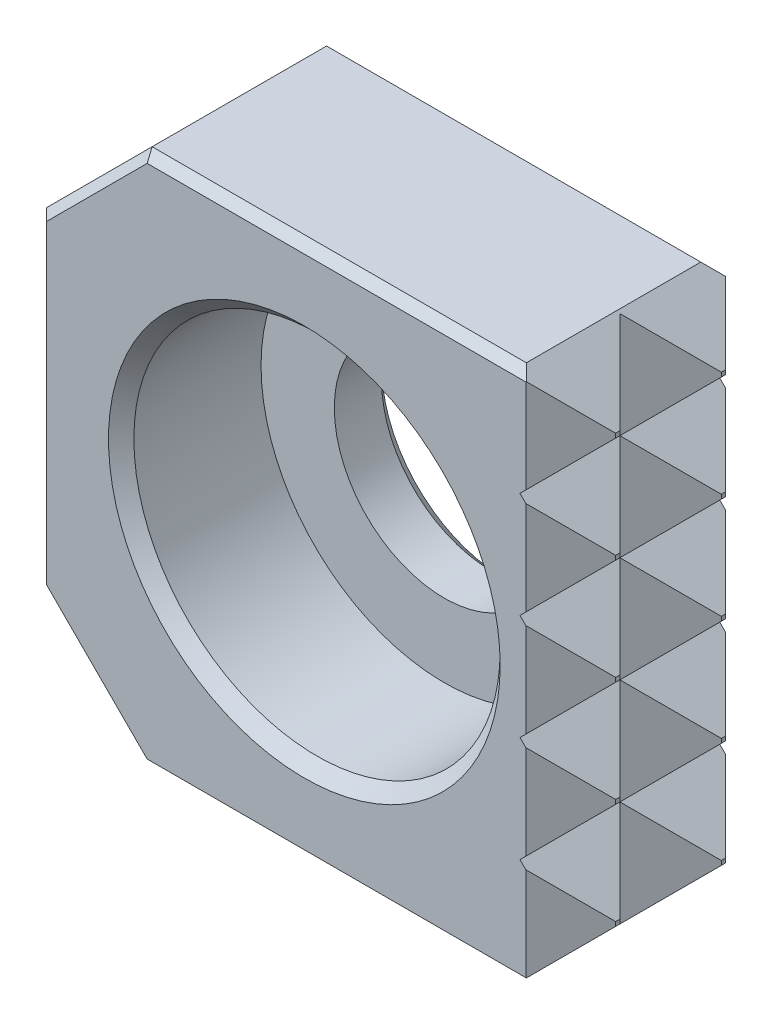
ISO-10303-21;
HEADER;
FILE_DESCRIPTION(('STEP AP214'),'2;1');
FILE_NAME('part.step','',(''),(''),'','','');
FILE_SCHEMA(('AUTOMOTIVE_DESIGN { 1 0 10303 214 1 1 1 1 }'));
ENDSEC;
DATA;
#1=APPLICATION_CONTEXT('core data for automotive mechanical design processes');
#2=APPLICATION_PROTOCOL_DEFINITION('international standard','automotive_design',2000,#1);
#3=PRODUCT_CONTEXT('',#1,'mechanical');
#4=PRODUCT('Part','Part','',(#3));
#5=PRODUCT_RELATED_PRODUCT_CATEGORY('part','',(#4));
#6=PRODUCT_DEFINITION_FORMATION('','',#4);
#7=PRODUCT_DEFINITION_CONTEXT('part definition',#1,'design');
#8=PRODUCT_DEFINITION('design','',#6,#7);
#9=PRODUCT_DEFINITION_SHAPE('','',#8);
#10=(LENGTH_UNIT() NAMED_UNIT(*) SI_UNIT(.MILLI.,.METRE.));
#11=(NAMED_UNIT(*) PLANE_ANGLE_UNIT() SI_UNIT($,.RADIAN.));
#12=(NAMED_UNIT(*) SI_UNIT($,.STERADIAN.) SOLID_ANGLE_UNIT());
#13=UNCERTAINTY_MEASURE_WITH_UNIT(LENGTH_MEASURE(1.E-05),#10,'distance_accuracy_value','');
#14=(GEOMETRIC_REPRESENTATION_CONTEXT(3) GLOBAL_UNCERTAINTY_ASSIGNED_CONTEXT((#13)) GLOBAL_UNIT_ASSIGNED_CONTEXT((#10,
#11,#12)) REPRESENTATION_CONTEXT('',''));
#15=CARTESIAN_POINT('',(0.,0.,0.));
#16=DIRECTION('',(0.,0.,1.));
#17=DIRECTION('',(1.,0.,0.));
#18=AXIS2_PLACEMENT_3D('',#15,#16,#17);
#19=CARTESIAN_POINT('',(8.,-8.,6.));
#20=DIRECTION('',(-1.,0.,0.));
#21=DIRECTION('',(0.,-1.,0.));
#22=AXIS2_PLACEMENT_3D('',#19,#20,#21);
#23=PLANE('',#22);
#24=DIRECTION('',(0.,-1.,0.));
#25=VECTOR('',#24,1.);
#26=CARTESIAN_POINT('',(8.,-8.,4.52399999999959));
#27=LINE('',#26,#25);
#28=CARTESIAN_POINT('',(8.,0.0635000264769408,4.52399999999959));
#29=VERTEX_POINT('',#28);
#30=CARTESIAN_POINT('',(8.,-0.0635000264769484,4.52399999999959));
#31=VERTEX_POINT('',#30);
#32=EDGE_CURVE('E540',#29,#31,#27,.T.);
#33=ORIENTED_EDGE('',*,*,#32,.F.);
#34=DIRECTION('',(0.,0.,-1.));
#35=VECTOR('',#34,1.);
#36=CARTESIAN_POINT('',(8.,0.0635000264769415,6.));
#37=LINE('',#36,#35);
#38=CARTESIAN_POINT('',(8.,0.0635000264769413,4.65099999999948));
#39=VERTEX_POINT('',#38);
#40=EDGE_CURVE('E360',#39,#29,#37,.T.);
#41=ORIENTED_EDGE('',*,*,#40,.F.);
#42=DIRECTION('',(0.,1.,0.));
#43=VECTOR('',#42,1.);
#44=CARTESIAN_POINT('',(8.,-8.,4.65099999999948));
#45=LINE('',#44,#43);
#46=CARTESIAN_POINT('',(8.,-0.0635000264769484,4.65099999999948));
#47=VERTEX_POINT('',#46);
#48=EDGE_CURVE('E509',#47,#39,#45,.T.);
#49=ORIENTED_EDGE('',*,*,#48,.F.);
#50=DIRECTION('',(0.,0.,-1.));
#51=VECTOR('',#50,1.);
#52=CARTESIAN_POINT('',(8.,-0.0635000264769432,6.));
#53=LINE('',#52,#51);
#54=EDGE_CURVE('E702',#47,#31,#53,.T.);
#55=ORIENTED_EDGE('',*,*,#54,.T.);
#56=EDGE_LOOP('',(#33,#41,#49,#55));
#57=FACE_BOUND('',#56,.T.);
#58=ADVANCED_FACE('F14',(#57),#23,.F.);
#59=CARTESIAN_POINT('',(8.,-0.0635000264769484,1.47600000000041));
#60=VERTEX_POINT('',#59);
#61=CARTESIAN_POINT('',(8.,-0.0635000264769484,1.34900000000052));
#62=VERTEX_POINT('',#61);
#63=EDGE_CURVE('E699',#60,#62,#53,.T.);
#64=ORIENTED_EDGE('',*,*,#63,.T.);
#65=DIRECTION('',(0.,1.,0.));
#66=VECTOR('',#65,1.);
#67=CARTESIAN_POINT('',(8.,-8.,1.34900000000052));
#68=LINE('',#67,#66);
#69=CARTESIAN_POINT('',(8.,0.0635000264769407,1.34900000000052));
#70=VERTEX_POINT('',#69);
#71=EDGE_CURVE('E620',#62,#70,#68,.T.);
#72=ORIENTED_EDGE('',*,*,#71,.T.);
#73=CARTESIAN_POINT('',(8.,0.0635000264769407,1.47600000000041));
#74=VERTEX_POINT('',#73);
#75=EDGE_CURVE('E353',#74,#70,#37,.T.);
#76=ORIENTED_EDGE('',*,*,#75,.F.);
#77=DIRECTION('',(0.,-1.,0.));
#78=VECTOR('',#77,1.);
#79=CARTESIAN_POINT('',(8.,-8.,1.47600000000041));
#80=LINE('',#79,#78);
#81=EDGE_CURVE('E575',#74,#60,#80,.T.);
#82=ORIENTED_EDGE('',*,*,#81,.T.);
#83=EDGE_LOOP('',(#64,#72,#76,#82));
#84=FACE_BOUND('',#83,.T.);
#85=ADVANCED_FACE('F902',(#84),#23,.F.);
#86=DIRECTION('',(0.,-1.,0.));
#87=VECTOR('',#86,1.);
#88=CARTESIAN_POINT('',(8.,-8.,4.52399999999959));
#89=LINE('',#88,#87);
#90=CARTESIAN_POINT('',(8.,3.23850002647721,4.52399999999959));
#91=VERTEX_POINT('',#90);
#92=CARTESIAN_POINT('',(8.,3.11150002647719,4.52399999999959));
#93=VERTEX_POINT('',#92);
#94=EDGE_CURVE('E538',#91,#93,#89,.T.);
#95=ORIENTED_EDGE('',*,*,#94,.F.);
#96=DIRECTION('',(0.,0.,-1.));
#97=VECTOR('',#96,1.);
#98=CARTESIAN_POINT('',(8.,3.23850002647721,6.));
#99=LINE('',#98,#97);
#100=CARTESIAN_POINT('',(8.,3.23850002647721,4.65099999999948));
#101=VERTEX_POINT('',#100);
#102=EDGE_CURVE('E343',#101,#91,#99,.T.);
#103=ORIENTED_EDGE('',*,*,#102,.F.);
#104=DIRECTION('',(0.,1.,0.));
#105=VECTOR('',#104,1.);
#106=CARTESIAN_POINT('',(8.,-8.,4.65099999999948));
#107=LINE('',#106,#105);
#108=CARTESIAN_POINT('',(8.,3.11150002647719,4.65099999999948));
#109=VERTEX_POINT('',#108);
#110=EDGE_CURVE('E325',#109,#101,#107,.T.);
#111=ORIENTED_EDGE('',*,*,#110,.F.);
#112=DIRECTION('',(0.,0.,1.));
#113=VECTOR('',#112,1.);
#114=CARTESIAN_POINT('',(8.,3.11150002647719,6.));
#115=LINE('',#114,#113);
#116=EDGE_CURVE('E341',#93,#109,#115,.T.);
#117=ORIENTED_EDGE('',*,*,#116,.F.);
#118=EDGE_LOOP('',(#95,#103,#111,#117));
#119=FACE_BOUND('',#118,.T.);
#120=ADVANCED_FACE('F340',(#119),#23,.F.);
#121=CARTESIAN_POINT('',(8.,3.11150002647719,1.34900000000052));
#122=VERTEX_POINT('',#121);
#123=CARTESIAN_POINT('',(8.,3.11150002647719,1.47600000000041));
#124=VERTEX_POINT('',#123);
#125=EDGE_CURVE('E350',#122,#124,#115,.T.);
#126=ORIENTED_EDGE('',*,*,#125,.F.);
#127=DIRECTION('',(0.,1.,0.));
#128=VECTOR('',#127,1.);
#129=CARTESIAN_POINT('',(8.,-8.,1.34900000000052));
#130=LINE('',#129,#128);
#131=CARTESIAN_POINT('',(8.,3.23850002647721,1.34900000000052));
#132=VERTEX_POINT('',#131);
#133=EDGE_CURVE('E611',#122,#132,#130,.T.);
#134=ORIENTED_EDGE('',*,*,#133,.T.);
#135=CARTESIAN_POINT('',(8.,3.23850002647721,1.47600000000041));
#136=VERTEX_POINT('',#135);
#137=EDGE_CURVE('E354',#136,#132,#99,.T.);
#138=ORIENTED_EDGE('',*,*,#137,.F.);
#139=DIRECTION('',(0.,-1.,0.));
#140=VECTOR('',#139,1.);
#141=CARTESIAN_POINT('',(8.,-8.,1.47600000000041));
#142=LINE('',#141,#140);
#143=EDGE_CURVE('E572',#136,#124,#142,.T.);
#144=ORIENTED_EDGE('',*,*,#143,.T.);
#145=EDGE_LOOP('',(#126,#134,#138,#144));
#146=FACE_BOUND('',#145,.T.);
#147=ADVANCED_FACE('F853',(#146),#23,.F.);
#148=DIRECTION('',(0.,-1.,0.));
#149=VECTOR('',#148,1.);
#150=CARTESIAN_POINT('',(8.,-8.,4.52399999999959));
#151=LINE('',#150,#149);
#152=CARTESIAN_POINT('',(8.,6.41350002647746,4.52399999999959));
#153=VERTEX_POINT('',#152);
#154=CARTESIAN_POINT('',(8.,6.28650002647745,4.52399999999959));
#155=VERTEX_POINT('',#154);
#156=EDGE_CURVE('E551',#153,#155,#151,.T.);
#157=ORIENTED_EDGE('',*,*,#156,.F.);
#158=DIRECTION('',(0.,0.,-1.));
#159=VECTOR('',#158,1.);
#160=CARTESIAN_POINT('',(8.,6.41350002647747,6.));
#161=LINE('',#160,#159);
#162=CARTESIAN_POINT('',(8.,6.41350002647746,4.65099999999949));
#163=VERTEX_POINT('',#162);
#164=EDGE_CURVE('E725',#163,#153,#161,.T.);
#165=ORIENTED_EDGE('',*,*,#164,.F.);
#166=DIRECTION('',(0.,1.,0.));
#167=VECTOR('',#166,1.);
#168=CARTESIAN_POINT('',(8.,-8.,4.65099999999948));
#169=LINE('',#168,#167);
#170=CARTESIAN_POINT('',(8.,6.28650002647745,4.65099999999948));
#171=VERTEX_POINT('',#170);
#172=EDGE_CURVE('E516',#171,#163,#169,.T.);
#173=ORIENTED_EDGE('',*,*,#172,.F.);
#174=DIRECTION('',(0.,0.,1.));
#175=VECTOR('',#174,1.);
#176=CARTESIAN_POINT('',(8.,6.28650002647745,6.));
#177=LINE('',#176,#175);
#178=EDGE_CURVE('E726',#155,#171,#177,.T.);
#179=ORIENTED_EDGE('',*,*,#178,.F.);
#180=EDGE_LOOP('',(#157,#165,#173,#179));
#181=FACE_BOUND('',#180,.T.);
#182=ADVANCED_FACE('F739',(#181),#23,.F.);
#183=CARTESIAN_POINT('',(8.,6.28650002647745,1.34900000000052));
#184=VERTEX_POINT('',#183);
#185=CARTESIAN_POINT('',(8.,6.28650002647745,1.47600000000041));
#186=VERTEX_POINT('',#185);
#187=EDGE_CURVE('E728',#184,#186,#177,.T.);
#188=ORIENTED_EDGE('',*,*,#187,.F.);
#189=DIRECTION('',(0.,1.,0.));
#190=VECTOR('',#189,1.);
#191=CARTESIAN_POINT('',(8.,-8.,1.34900000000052));
#192=LINE('',#191,#190);
#193=CARTESIAN_POINT('',(8.,6.41350002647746,1.34900000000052));
#194=VERTEX_POINT('',#193);
#195=EDGE_CURVE('E629',#184,#194,#192,.T.);
#196=ORIENTED_EDGE('',*,*,#195,.T.);
#197=CARTESIAN_POINT('',(8.,6.41350002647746,1.47600000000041));
#198=VERTEX_POINT('',#197);
#199=EDGE_CURVE('E723',#198,#194,#161,.T.);
#200=ORIENTED_EDGE('',*,*,#199,.F.);
#201=DIRECTION('',(0.,-1.,0.));
#202=VECTOR('',#201,1.);
#203=CARTESIAN_POINT('',(8.,-8.,1.47600000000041));
#204=LINE('',#203,#202);
#205=EDGE_CURVE('E586',#198,#186,#204,.T.);
#206=ORIENTED_EDGE('',*,*,#205,.T.);
#207=EDGE_LOOP('',(#188,#196,#200,#206));
#208=FACE_BOUND('',#207,.T.);
#209=ADVANCED_FACE('F775',(#208),#23,.F.);
#210=DIRECTION('',(0.,-1.,0.));
#211=VECTOR('',#210,1.);
#212=CARTESIAN_POINT('',(8.,-8.,4.52399999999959));
#213=LINE('',#212,#211);
#214=CARTESIAN_POINT('',(8.,-6.28650002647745,4.52399999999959));
#215=VERTEX_POINT('',#214);
#216=CARTESIAN_POINT('',(8.,-6.41350002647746,4.52399999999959));
#217=VERTEX_POINT('',#216);
#218=EDGE_CURVE('E565',#215,#217,#213,.T.);
#219=ORIENTED_EDGE('',*,*,#218,.F.);
#220=DIRECTION('',(0.,0.,1.));
#221=VECTOR('',#220,1.);
#222=CARTESIAN_POINT('',(8.,-6.28650002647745,6.));
#223=LINE('',#222,#221);
#224=CARTESIAN_POINT('',(8.,-6.28650002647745,4.65099999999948));
#225=VERTEX_POINT('',#224);
#226=EDGE_CURVE('E711',#215,#225,#223,.T.);
#227=ORIENTED_EDGE('',*,*,#226,.T.);
#228=DIRECTION('',(0.,1.,0.));
#229=VECTOR('',#228,1.);
#230=CARTESIAN_POINT('',(8.,-8.,4.65099999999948));
#231=LINE('',#230,#229);
#232=CARTESIAN_POINT('',(8.,-6.41350002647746,4.65099999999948));
#233=VERTEX_POINT('',#232);
#234=EDGE_CURVE('E524',#233,#225,#231,.T.);
#235=ORIENTED_EDGE('',*,*,#234,.F.);
#236=DIRECTION('',(0.,0.,-1.));
#237=VECTOR('',#236,1.);
#238=CARTESIAN_POINT('',(8.,-6.41350002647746,6.));
#239=LINE('',#238,#237);
#240=EDGE_CURVE('E720',#233,#217,#239,.T.);
#241=ORIENTED_EDGE('',*,*,#240,.T.);
#242=EDGE_LOOP('',(#219,#227,#235,#241));
#243=FACE_BOUND('',#242,.T.);
#244=ADVANCED_FACE('F977',(#243),#23,.F.);
#245=CARTESIAN_POINT('',(8.,-6.41350002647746,1.47600000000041));
#246=VERTEX_POINT('',#245);
#247=CARTESIAN_POINT('',(8.,-6.41350002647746,1.34900000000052));
#248=VERTEX_POINT('',#247);
#249=EDGE_CURVE('E717',#246,#248,#239,.T.);
#250=ORIENTED_EDGE('',*,*,#249,.T.);
#251=DIRECTION('',(0.,1.,0.));
#252=VECTOR('',#251,1.);
#253=CARTESIAN_POINT('',(8.,-8.,1.34900000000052));
#254=LINE('',#253,#252);
#255=CARTESIAN_POINT('',(8.,-6.28650002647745,1.34900000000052));
#256=VERTEX_POINT('',#255);
#257=EDGE_CURVE('E636',#248,#256,#254,.T.);
#258=ORIENTED_EDGE('',*,*,#257,.T.);
#259=CARTESIAN_POINT('',(8.,-6.28650002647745,1.47600000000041));
#260=VERTEX_POINT('',#259);
#261=EDGE_CURVE('E714',#256,#260,#223,.T.);
#262=ORIENTED_EDGE('',*,*,#261,.T.);
#263=DIRECTION('',(0.,-1.,0.));
#264=VECTOR('',#263,1.);
#265=CARTESIAN_POINT('',(8.,-8.,1.47600000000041));
#266=LINE('',#265,#264);
#267=EDGE_CURVE('E603',#260,#246,#266,.T.);
#268=ORIENTED_EDGE('',*,*,#267,.T.);
#269=EDGE_LOOP('',(#250,#258,#262,#268));
#270=FACE_BOUND('',#269,.T.);
#271=ADVANCED_FACE('F882',(#270),#23,.F.);
#272=DIRECTION('',(0.,-1.,0.));
#273=VECTOR('',#272,1.);
#274=CARTESIAN_POINT('',(8.,-8.,4.52399999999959));
#275=LINE('',#274,#273);
#276=CARTESIAN_POINT('',(8.,-3.11150002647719,4.52399999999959));
#277=VERTEX_POINT('',#276);
#278=CARTESIAN_POINT('',(8.,-3.23850002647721,4.52399999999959));
#279=VERTEX_POINT('',#278);
#280=EDGE_CURVE('E558',#277,#279,#275,.T.);
#281=ORIENTED_EDGE('',*,*,#280,.F.);
#282=DIRECTION('',(0.,0.,1.));
#283=VECTOR('',#282,1.);
#284=CARTESIAN_POINT('',(8.,-3.11150002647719,6.));
#285=LINE('',#284,#283);
#286=CARTESIAN_POINT('',(8.,-3.11150002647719,4.65099999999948));
#287=VERTEX_POINT('',#286);
#288=EDGE_CURVE('E703',#277,#287,#285,.T.);
#289=ORIENTED_EDGE('',*,*,#288,.T.);
#290=DIRECTION('',(0.,1.,0.));
#291=VECTOR('',#290,1.);
#292=CARTESIAN_POINT('',(8.,-8.,4.65099999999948));
#293=LINE('',#292,#291);
#294=CARTESIAN_POINT('',(8.,-3.23850002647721,4.65099999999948));
#295=VERTEX_POINT('',#294);
#296=EDGE_CURVE('E531',#295,#287,#293,.T.);
#297=ORIENTED_EDGE('',*,*,#296,.F.);
#298=DIRECTION('',(0.,0.,-1.));
#299=VECTOR('',#298,1.);
#300=CARTESIAN_POINT('',(8.,-3.23850002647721,6.));
#301=LINE('',#300,#299);
#302=EDGE_CURVE('E710',#295,#279,#301,.T.);
#303=ORIENTED_EDGE('',*,*,#302,.T.);
#304=EDGE_LOOP('',(#281,#289,#297,#303));
#305=FACE_BOUND('',#304,.T.);
#306=ADVANCED_FACE('F911',(#305),#23,.F.);
#307=CARTESIAN_POINT('',(8.,-3.23850002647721,1.47600000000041));
#308=VERTEX_POINT('',#307);
#309=CARTESIAN_POINT('',(8.,-3.23850002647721,1.34900000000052));
#310=VERTEX_POINT('',#309);
#311=EDGE_CURVE('E707',#308,#310,#301,.T.);
#312=ORIENTED_EDGE('',*,*,#311,.T.);
#313=DIRECTION('',(0.,1.,0.));
#314=VECTOR('',#313,1.);
#315=CARTESIAN_POINT('',(8.,-8.,1.34900000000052));
#316=LINE('',#315,#314);
#317=CARTESIAN_POINT('',(8.,-3.11150002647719,1.34900000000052));
#318=VERTEX_POINT('',#317);
#319=EDGE_CURVE('E646',#310,#318,#316,.T.);
#320=ORIENTED_EDGE('',*,*,#319,.T.);
#321=CARTESIAN_POINT('',(8.,-3.11150002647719,1.47600000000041));
#322=VERTEX_POINT('',#321);
#323=EDGE_CURVE('E706',#318,#322,#285,.T.);
#324=ORIENTED_EDGE('',*,*,#323,.T.);
#325=DIRECTION('',(0.,-1.,0.));
#326=VECTOR('',#325,1.);
#327=CARTESIAN_POINT('',(8.,-8.,1.47600000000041));
#328=LINE('',#327,#326);
#329=EDGE_CURVE('E594',#322,#308,#328,.T.);
#330=ORIENTED_EDGE('',*,*,#329,.T.);
#331=EDGE_LOOP('',(#312,#320,#324,#330));
#332=FACE_BOUND('',#331,.T.);
#333=ADVANCED_FACE('F904',(#332),#23,.F.);
#334=CARTESIAN_POINT('',(8.,8.,6.));
#335=DIRECTION('',(0.,0.,-1.));
#336=DIRECTION('',(1.,0.,0.));
#337=AXIS2_PLACEMENT_3D('',#334,#335,#336);
#338=PLANE('',#337);
#339=CARTESIAN_POINT('',(0.,0.,6.));
#340=DIRECTION('',(0.,0.,-1.));
#341=DIRECTION('',(1.,0.,0.));
#342=AXIS2_PLACEMENT_3D('',#339,#340,#341);
#343=CIRCLE('',#342,5.881);
#344=CARTESIAN_POINT('',(5.881,0.,6.));
#345=VERTEX_POINT('',#344);
#346=EDGE_CURVE('E395',#345,#345,#343,.T.);
#347=ORIENTED_EDGE('',*,*,#346,.T.);
#348=EDGE_LOOP('',(#347));
#349=FACE_BOUND('',#348,.T.);
#350=DIRECTION('',(0.707106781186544,-0.707106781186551,0.));
#351=VECTOR('',#350,1.);
#352=CARTESIAN_POINT('',(-4.64539487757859,-7.82039487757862,6.));
#353=LINE('',#352,#351);
#354=CARTESIAN_POINT('',(-7.746,-4.71978975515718,6.));
#355=VERTEX_POINT('',#354);
#356=CARTESIAN_POINT('',(-4.71978975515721,-7.746,6.));
#357=VERTEX_POINT('',#356);
#358=EDGE_CURVE('E446',#355,#357,#353,.T.);
#359=ORIENTED_EDGE('',*,*,#358,.T.);
#360=DIRECTION('',(1.,0.,0.));
#361=VECTOR('',#360,1.);
#362=CARTESIAN_POINT('',(6.41350068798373,-7.746,6.));
#363=LINE('',#362,#361);
#364=CARTESIAN_POINT('',(6.651,-7.746,6.));
#365=VERTEX_POINT('',#364);
#366=EDGE_CURVE('E448',#357,#365,#363,.T.);
#367=ORIENTED_EDGE('',*,*,#366,.T.);
#368=DIRECTION('',(0.,-1.,0.));
#369=VECTOR('',#368,1.);
#370=CARTESIAN_POINT('',(6.651,8.,6.));
#371=LINE('',#370,#369);
#372=CARTESIAN_POINT('',(6.651,-4.93750058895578,6.));
#373=VERTEX_POINT('',#372);
#374=EDGE_CURVE('E523',#373,#365,#371,.T.);
#375=ORIENTED_EDGE('',*,*,#374,.F.);
#376=DIRECTION('',(0.707106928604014,-0.707106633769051,0.));
#377=VECTOR('',#376,1.);
#378=CARTESIAN_POINT('',(6.476,-4.76250066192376,6.));
#379=LINE('',#378,#377);
#380=CARTESIAN_POINT('',(6.476,-4.76250066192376,6.));
#381=VERTEX_POINT('',#380);
#382=EDGE_CURVE('E661',#381,#373,#379,.T.);
#383=ORIENTED_EDGE('',*,*,#382,.F.);
#384=DIRECTION('',(-0.707106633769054,-0.70710692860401,0.));
#385=VECTOR('',#384,1.);
#386=CARTESIAN_POINT('',(8.0635,-3.17500000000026,6.));
#387=LINE('',#386,#385);
#388=CARTESIAN_POINT('',(6.651,-4.58750058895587,6.));
#389=VERTEX_POINT('',#388);
#390=EDGE_CURVE('E664',#389,#381,#387,.T.);
#391=ORIENTED_EDGE('',*,*,#390,.F.);
#392=CARTESIAN_POINT('',(6.651,-1.76250058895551,6.));
#393=VERTEX_POINT('',#392);
#394=EDGE_CURVE('E530',#393,#389,#371,.T.);
#395=ORIENTED_EDGE('',*,*,#394,.F.);
#396=DIRECTION('',(0.707106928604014,-0.707106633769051,0.));
#397=VECTOR('',#396,1.);
#398=CARTESIAN_POINT('',(6.476,-1.58750066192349,6.));
#399=LINE('',#398,#397);
#400=CARTESIAN_POINT('',(6.476,-1.58750066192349,6.));
#401=VERTEX_POINT('',#400);
#402=EDGE_CURVE('E666',#401,#393,#399,.T.);
#403=ORIENTED_EDGE('',*,*,#402,.F.);
#404=DIRECTION('',(-0.707106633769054,-0.70710692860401,0.));
#405=VECTOR('',#404,1.);
#406=CARTESIAN_POINT('',(8.0635,0.,6.));
#407=LINE('',#406,#405);
#408=CARTESIAN_POINT('',(6.651,-1.41250058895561,6.));
#409=VERTEX_POINT('',#408);
#410=EDGE_CURVE('E669',#409,#401,#407,.T.);
#411=ORIENTED_EDGE('',*,*,#410,.F.);
#412=CARTESIAN_POINT('',(6.651,1.41250058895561,6.));
#413=VERTEX_POINT('',#412);
#414=EDGE_CURVE('E503',#413,#409,#371,.T.);
#415=ORIENTED_EDGE('',*,*,#414,.F.);
#416=DIRECTION('',(-0.707106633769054,0.70710692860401,0.));
#417=VECTOR('',#416,1.);
#418=CARTESIAN_POINT('',(8.0635,0.,6.));
#419=LINE('',#418,#417);
#420=CARTESIAN_POINT('',(6.476,1.58750066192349,6.));
#421=VERTEX_POINT('',#420);
#422=EDGE_CURVE('E652',#413,#421,#419,.T.);
#423=ORIENTED_EDGE('',*,*,#422,.T.);
#424=DIRECTION('',(0.707106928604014,0.707106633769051,0.));
#425=VECTOR('',#424,1.);
#426=CARTESIAN_POINT('',(6.476,1.58750066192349,6.));
#427=LINE('',#426,#425);
#428=CARTESIAN_POINT('',(6.651,1.76250058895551,6.));
#429=VERTEX_POINT('',#428);
#430=EDGE_CURVE('E654',#421,#429,#427,.T.);
#431=ORIENTED_EDGE('',*,*,#430,.T.);
#432=CARTESIAN_POINT('',(6.651,4.58750058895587,6.));
#433=VERTEX_POINT('',#432);
#434=EDGE_CURVE('E328',#433,#429,#371,.T.);
#435=ORIENTED_EDGE('',*,*,#434,.F.);
#436=DIRECTION('',(-0.707106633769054,0.70710692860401,0.));
#437=VECTOR('',#436,1.);
#438=CARTESIAN_POINT('',(8.0635,3.17500000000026,6.));
#439=LINE('',#438,#437);
#440=CARTESIAN_POINT('',(6.476,4.76250066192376,6.));
#441=VERTEX_POINT('',#440);
#442=EDGE_CURVE('E656',#433,#441,#439,.T.);
#443=ORIENTED_EDGE('',*,*,#442,.T.);
#444=DIRECTION('',(0.707106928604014,0.707106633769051,0.));
#445=VECTOR('',#444,1.);
#446=CARTESIAN_POINT('',(6.476,4.76250066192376,6.));
#447=LINE('',#446,#445);
#448=CARTESIAN_POINT('',(6.651,4.93750058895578,6.));
#449=VERTEX_POINT('',#448);
#450=EDGE_CURVE('E658',#441,#449,#447,.T.);
#451=ORIENTED_EDGE('',*,*,#450,.T.);
#452=CARTESIAN_POINT('',(6.651,7.746,6.));
#453=VERTEX_POINT('',#452);
#454=EDGE_CURVE('E502',#453,#449,#371,.T.);
#455=ORIENTED_EDGE('',*,*,#454,.F.);
#456=DIRECTION('',(-1.,0.,0.));
#457=VECTOR('',#456,1.);
#458=CARTESIAN_POINT('',(-4.825,7.746,6.));
#459=LINE('',#458,#457);
#460=CARTESIAN_POINT('',(-4.71978975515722,7.746,6.));
#461=VERTEX_POINT('',#460);
#462=EDGE_CURVE('E440',#453,#461,#459,.T.);
#463=ORIENTED_EDGE('',*,*,#462,.T.);
#464=DIRECTION('',(-0.707106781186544,-0.707106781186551,0.));
#465=VECTOR('',#464,1.);
#466=CARTESIAN_POINT('',(-7.82039487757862,4.64539487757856,6.));
#467=LINE('',#466,#465);
#468=CARTESIAN_POINT('',(-7.746,4.71978975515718,6.));
#469=VERTEX_POINT('',#468);
#470=EDGE_CURVE('E442',#461,#469,#467,.T.);
#471=ORIENTED_EDGE('',*,*,#470,.T.);
#472=DIRECTION('',(0.,-1.,0.));
#473=VECTOR('',#472,1.);
#474=CARTESIAN_POINT('',(-7.746,8.,6.));
#475=LINE('',#474,#473);
#476=EDGE_CURVE('E444',#469,#355,#475,.T.);
#477=ORIENTED_EDGE('',*,*,#476,.T.);
#478=EDGE_LOOP('',(#359,#367,#375,#383,#391,#395,#403,#411,#415,#423,#431,#435,#443,#451,#455,
#463,#471,#477));
#479=FACE_BOUND('',#478,.T.);
#480=ADVANCED_FACE('F823',(#349,#479),#338,.F.);
#481=CARTESIAN_POINT('',(8.0635,0.,0.));
#482=DIRECTION('',(-0.70710692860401,0.707106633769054,0.));
#483=DIRECTION('',(-0.707106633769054,-0.70710692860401,0.));
#484=AXIS2_PLACEMENT_3D('',#481,#482,#483);
#485=PLANE('',#484);
#486=DIRECTION('',(-0.57735018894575,-0.5773504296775,-0.577350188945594));
#487=VECTOR('',#486,1.);
#488=CARTESIAN_POINT('',(6.53433375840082,-1.52916687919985,3.0583337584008));
#489=LINE('',#488,#487);
#490=CARTESIAN_POINT('',(6.476,-1.58750066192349,3.));
#491=VERTEX_POINT('',#490);
#492=EDGE_CURVE('E548',#31,#491,#489,.T.);
#493=ORIENTED_EDGE('',*,*,#492,.F.);
#494=ORIENTED_EDGE('',*,*,#54,.F.);
#495=DIRECTION('',(0.577350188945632,0.577350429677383,-0.577350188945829));
#496=VECTOR('',#495,1.);
#497=CARTESIAN_POINT('',(9.59266624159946,1.52916687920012,3.05833375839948));
#498=LINE('',#497,#496);
#499=EDGE_CURVE('E511',#409,#47,#498,.T.);
#500=ORIENTED_EDGE('',*,*,#499,.F.);
#501=ORIENTED_EDGE('',*,*,#410,.T.);
#502=DIRECTION('',(0.,0.,1.));
#503=VECTOR('',#502,1.);
#504=CARTESIAN_POINT('',(6.476,-1.58750066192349,0.));
#505=LINE('',#504,#503);
#506=EDGE_CURVE('E683',#491,#401,#505,.T.);
#507=ORIENTED_EDGE('',*,*,#506,.F.);
#508=EDGE_LOOP('',(#493,#494,#500,#501,#507));
#509=FACE_BOUND('',#508,.T.);
#510=ADVANCED_FACE('F917',(#509),#485,.F.);
#511=DIRECTION('',(0.707106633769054,0.70710692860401,0.));
#512=VECTOR('',#511,1.);
#513=CARTESIAN_POINT('',(12.0317500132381,3.96825166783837,0.));
#514=LINE('',#513,#512);
#515=CARTESIAN_POINT('',(6.476,-1.58750066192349,0.));
#516=VERTEX_POINT('',#515);
#517=CARTESIAN_POINT('',(6.651,-1.41250058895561,0.));
#518=VERTEX_POINT('',#517);
#519=EDGE_CURVE('E376',#516,#518,#514,.T.);
#520=ORIENTED_EDGE('',*,*,#519,.T.);
#521=DIRECTION('',(0.577350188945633,0.577350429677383,0.577350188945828));
#522=VECTOR('',#521,1.);
#523=CARTESIAN_POINT('',(7.59266679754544,-0.470833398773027,0.941666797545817));
#524=LINE('',#523,#522);
#525=EDGE_CURVE('E623',#518,#62,#524,.T.);
#526=ORIENTED_EDGE('',*,*,#525,.T.);
#527=ORIENTED_EDGE('',*,*,#63,.F.);
#528=DIRECTION('',(-0.57735018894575,-0.5773504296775,0.577350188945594));
#529=VECTOR('',#528,1.);
#530=CARTESIAN_POINT('',(8.53433320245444,0.470833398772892,0.94166679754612));
#531=LINE('',#530,#529);
#532=EDGE_CURVE('E583',#60,#491,#531,.T.);
#533=ORIENTED_EDGE('',*,*,#532,.T.);
#534=EDGE_CURVE('E684',#516,#491,#505,.T.);
#535=ORIENTED_EDGE('',*,*,#534,.F.);
#536=EDGE_LOOP('',(#520,#526,#527,#533,#535));
#537=FACE_BOUND('',#536,.T.);
#538=ADVANCED_FACE('F932',(#537),#485,.F.);
#539=CARTESIAN_POINT('',(6.476,-1.58750066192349,0.));
#540=DIRECTION('',(-0.707106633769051,-0.707106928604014,0.));
#541=DIRECTION('',(0.707106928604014,-0.707106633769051,0.));
#542=AXIS2_PLACEMENT_3D('',#539,#540,#541);
#543=PLANE('',#542);
#544=DIRECTION('',(0.577350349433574,-0.577350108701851,0.577350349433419));
#545=VECTOR('',#544,1.);
#546=CARTESIAN_POINT('',(5.47599972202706,-0.587500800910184,1.99999972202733));
#547=LINE('',#546,#545);
#548=EDGE_CURVE('E556',#491,#277,#547,.T.);
#549=ORIENTED_EDGE('',*,*,#548,.F.);
#550=ORIENTED_EDGE('',*,*,#506,.T.);
#551=ORIENTED_EDGE('',*,*,#402,.T.);
#552=DIRECTION('',(-0.577350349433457,0.577350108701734,0.577350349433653));
#553=VECTOR('',#552,1.);
#554=CARTESIAN_POINT('',(8.53433390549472,-3.64583370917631,4.11666609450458));
#555=LINE('',#554,#553);
#556=EDGE_CURVE('E533',#287,#393,#555,.T.);
#557=ORIENTED_EDGE('',*,*,#556,.F.);
#558=ORIENTED_EDGE('',*,*,#288,.F.);
#559=EDGE_LOOP('',(#549,#550,#551,#557,#558));
#560=FACE_BOUND('',#559,.T.);
#561=ADVANCED_FACE('F953',(#560),#543,.F.);
#562=ORIENTED_EDGE('',*,*,#323,.F.);
#563=DIRECTION('',(-0.577350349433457,0.577350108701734,-0.577350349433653));
#564=VECTOR('',#563,1.);
#565=CARTESIAN_POINT('',(6.53433334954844,-1.64583398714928,-0.116666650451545));
#566=LINE('',#565,#564);
#567=CARTESIAN_POINT('',(6.651,-1.76250058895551,0.));
#568=VERTEX_POINT('',#567);
#569=EDGE_CURVE('E649',#318,#568,#566,.T.);
#570=ORIENTED_EDGE('',*,*,#569,.T.);
#571=DIRECTION('',(0.707106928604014,-0.707106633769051,0.));
#572=VECTOR('',#571,1.);
#573=CARTESIAN_POINT('',(6.476,-1.58750066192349,0.));
#574=LINE('',#573,#572);
#575=EDGE_CURVE('E680',#516,#568,#574,.T.);
#576=ORIENTED_EDGE('',*,*,#575,.F.);
#577=ORIENTED_EDGE('',*,*,#534,.T.);
#578=DIRECTION('',(0.577350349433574,-0.577350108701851,-0.577350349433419));
#579=VECTOR('',#578,1.);
#580=CARTESIAN_POINT('',(7.47600027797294,-2.5875005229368,1.99999972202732));
#581=LINE('',#580,#579);
#582=EDGE_CURVE('E591',#491,#322,#581,.T.);
#583=ORIENTED_EDGE('',*,*,#582,.T.);
#584=EDGE_LOOP('',(#562,#570,#576,#577,#583));
#585=FACE_BOUND('',#584,.T.);
#586=ADVANCED_FACE('F928',(#585),#543,.F.);
#587=CARTESIAN_POINT('',(8.0635,-3.17500000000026,0.));
#588=DIRECTION('',(-0.70710692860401,0.707106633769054,0.));
#589=DIRECTION('',(-0.707106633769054,-0.70710692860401,0.));
#590=AXIS2_PLACEMENT_3D('',#587,#588,#589);
#591=PLANE('',#590);
#592=DIRECTION('',(-0.57735018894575,-0.5773504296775,-0.577350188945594));
#593=VECTOR('',#592,1.);
#594=CARTESIAN_POINT('',(6.53433375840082,-4.70416687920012,3.0583337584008));
#595=LINE('',#594,#593);
#596=CARTESIAN_POINT('',(6.476,-4.76250066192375,3.));
#597=VERTEX_POINT('',#596);
#598=EDGE_CURVE('E560',#279,#597,#595,.T.);
#599=ORIENTED_EDGE('',*,*,#598,.F.);
#600=ORIENTED_EDGE('',*,*,#302,.F.);
#601=DIRECTION('',(0.577350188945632,0.577350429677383,-0.577350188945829));
#602=VECTOR('',#601,1.);
#603=CARTESIAN_POINT('',(9.59266624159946,-1.64583312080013,3.05833375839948));
#604=LINE('',#603,#602);
#605=EDGE_CURVE('E528',#389,#295,#604,.T.);
#606=ORIENTED_EDGE('',*,*,#605,.F.);
#607=ORIENTED_EDGE('',*,*,#390,.T.);
#608=DIRECTION('',(0.,0.,1.));
#609=VECTOR('',#608,1.);
#610=CARTESIAN_POINT('',(6.476,-4.76250066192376,0.));
#611=LINE('',#610,#609);
#612=EDGE_CURVE('E687',#597,#381,#611,.T.);
#613=ORIENTED_EDGE('',*,*,#612,.F.);
#614=EDGE_LOOP('',(#599,#600,#606,#607,#613));
#615=FACE_BOUND('',#614,.T.);
#616=ADVANCED_FACE('F963',(#615),#591,.F.);
#617=DIRECTION('',(0.707106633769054,0.70710692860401,0.));
#618=VECTOR('',#617,1.);
#619=CARTESIAN_POINT('',(13.6192500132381,2.3807523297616,0.));
#620=LINE('',#619,#618);
#621=CARTESIAN_POINT('',(6.476,-4.76250066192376,0.));
#622=VERTEX_POINT('',#621);
#623=CARTESIAN_POINT('',(6.651,-4.58750058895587,0.));
#624=VERTEX_POINT('',#623);
#625=EDGE_CURVE('E379',#622,#624,#620,.T.);
#626=ORIENTED_EDGE('',*,*,#625,.T.);
#627=DIRECTION('',(0.577350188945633,0.577350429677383,0.577350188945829));
#628=VECTOR('',#627,1.);
#629=CARTESIAN_POINT('',(7.59266679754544,-3.64583339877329,0.941666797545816));
#630=LINE('',#629,#628);
#631=EDGE_CURVE('E642',#624,#310,#630,.T.);
#632=ORIENTED_EDGE('',*,*,#631,.T.);
#633=ORIENTED_EDGE('',*,*,#311,.F.);
#634=DIRECTION('',(-0.57735018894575,-0.5773504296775,0.577350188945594));
#635=VECTOR('',#634,1.);
#636=CARTESIAN_POINT('',(8.53433320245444,-2.70416660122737,0.94166679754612));
#637=LINE('',#636,#635);
#638=EDGE_CURVE('E597',#308,#597,#637,.T.);
#639=ORIENTED_EDGE('',*,*,#638,.T.);
#640=EDGE_CURVE('E688',#622,#597,#611,.T.);
#641=ORIENTED_EDGE('',*,*,#640,.F.);
#642=EDGE_LOOP('',(#626,#632,#633,#639,#641));
#643=FACE_BOUND('',#642,.T.);
#644=ADVANCED_FACE('F877',(#643),#591,.F.);
#645=CARTESIAN_POINT('',(6.476,-4.76250066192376,0.));
#646=DIRECTION('',(-0.707106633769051,-0.707106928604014,0.));
#647=DIRECTION('',(0.707106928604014,-0.707106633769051,0.));
#648=AXIS2_PLACEMENT_3D('',#645,#646,#647);
#649=PLANE('',#648);
#650=DIRECTION('',(0.577350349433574,-0.577350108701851,0.577350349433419));
#651=VECTOR('',#650,1.);
#652=CARTESIAN_POINT('',(5.47599972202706,-3.76250080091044,1.99999972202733));
#653=LINE('',#652,#651);
#654=EDGE_CURVE('E563',#597,#215,#653,.T.);
#655=ORIENTED_EDGE('',*,*,#654,.F.);
#656=ORIENTED_EDGE('',*,*,#612,.T.);
#657=ORIENTED_EDGE('',*,*,#382,.T.);
#658=DIRECTION('',(-0.577350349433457,0.577350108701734,0.577350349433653));
#659=VECTOR('',#658,1.);
#660=CARTESIAN_POINT('',(8.53433390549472,-6.82083370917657,4.11666609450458));
#661=LINE('',#660,#659);
#662=EDGE_CURVE('E526',#225,#373,#661,.T.);
#663=ORIENTED_EDGE('',*,*,#662,.F.);
#664=ORIENTED_EDGE('',*,*,#226,.F.);
#665=EDGE_LOOP('',(#655,#656,#657,#663,#664));
#666=FACE_BOUND('',#665,.T.);
#667=ADVANCED_FACE('F970',(#666),#649,.F.);
#668=ORIENTED_EDGE('',*,*,#261,.F.);
#669=DIRECTION('',(-0.577350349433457,0.577350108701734,-0.577350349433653));
#670=VECTOR('',#669,1.);
#671=CARTESIAN_POINT('',(6.53433334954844,-4.82083398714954,-0.116666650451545));
#672=LINE('',#671,#670);
#673=CARTESIAN_POINT('',(6.651,-4.93750058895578,0.));
#674=VERTEX_POINT('',#673);
#675=EDGE_CURVE('E639',#256,#674,#672,.T.);
#676=ORIENTED_EDGE('',*,*,#675,.T.);
#677=DIRECTION('',(0.707106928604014,-0.707106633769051,0.));
#678=VECTOR('',#677,1.);
#679=CARTESIAN_POINT('',(6.476,-4.76250066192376,0.));
#680=LINE('',#679,#678);
#681=EDGE_CURVE('E677',#622,#674,#680,.T.);
#682=ORIENTED_EDGE('',*,*,#681,.F.);
#683=ORIENTED_EDGE('',*,*,#640,.T.);
#684=DIRECTION('',(0.577350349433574,-0.577350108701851,-0.577350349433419));
#685=VECTOR('',#684,1.);
#686=CARTESIAN_POINT('',(7.47600027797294,-5.76250052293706,1.99999972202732));
#687=LINE('',#686,#685);
#688=EDGE_CURVE('E600',#597,#260,#687,.T.);
#689=ORIENTED_EDGE('',*,*,#688,.T.);
#690=EDGE_LOOP('',(#668,#676,#682,#683,#689));
#691=FACE_BOUND('',#690,.T.);
#692=ADVANCED_FACE('F872',(#691),#649,.F.);
#693=CARTESIAN_POINT('',(8.0635,-6.35000000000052,0.));
#694=DIRECTION('',(-0.707106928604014,0.707106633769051,0.));
#695=DIRECTION('',(-0.707106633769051,-0.707106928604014,0.));
#696=AXIS2_PLACEMENT_3D('',#693,#694,#695);
#697=PLANE('',#696);
#698=DIRECTION('',(0.57735018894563,0.577350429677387,-0.577350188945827));
#699=VECTOR('',#698,1.);
#700=CARTESIAN_POINT('',(9.59266624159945,-4.82083312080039,3.05833375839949));
#701=LINE('',#700,#699);
#702=CARTESIAN_POINT('',(6.659250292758,-7.75425029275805,5.99174970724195));
#703=VERTEX_POINT('',#702);
#704=EDGE_CURVE('E521',#703,#233,#701,.T.);
#705=ORIENTED_EDGE('',*,*,#704,.F.);
#706=DIRECTION('',(-0.577350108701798,-0.577350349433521,-0.577350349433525));
#707=VECTOR('',#706,1.);
#708=CARTESIAN_POINT('',(6.94233349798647,-7.47116696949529,6.27483303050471));
#709=LINE('',#708,#707);
#710=CARTESIAN_POINT('',(6.41350068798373,-8.,5.746));
#711=VERTEX_POINT('',#710);
#712=EDGE_CURVE('E452',#703,#711,#709,.T.);
#713=ORIENTED_EDGE('',*,*,#712,.T.);
#714=DIRECTION('',(0.,0.,-1.));
#715=VECTOR('',#714,1.);
#716=CARTESIAN_POINT('',(6.41350068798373,-8.,6.));
#717=LINE('',#716,#715);
#718=CARTESIAN_POINT('',(6.41350068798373,-8.,0.508));
#719=VERTEX_POINT('',#718);
#720=EDGE_CURVE('E715',#711,#719,#717,.T.);
#721=ORIENTED_EDGE('',*,*,#720,.T.);
#722=DIRECTION('',(-0.577350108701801,-0.577350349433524,0.577350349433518));
#723=VECTOR('',#722,1.);
#724=CARTESIAN_POINT('',(7.28100011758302,-7.13250020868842,-0.359499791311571));
#725=LINE('',#724,#723);
#726=CARTESIAN_POINT('',(6.78625026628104,-7.62725026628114,0.135250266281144));
#727=VERTEX_POINT('',#726);
#728=EDGE_CURVE('E418',#719,#727,#725,.F.);
#729=ORIENTED_EDGE('',*,*,#728,.T.);
#730=DIRECTION('',(0.577350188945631,0.577350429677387,0.577350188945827));
#731=VECTOR('',#730,1.);
#732=CARTESIAN_POINT('',(7.59266679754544,-6.82083339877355,0.941666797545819));
#733=LINE('',#732,#731);
#734=EDGE_CURVE('E634',#727,#248,#733,.T.);
#735=ORIENTED_EDGE('',*,*,#734,.T.);
#736=ORIENTED_EDGE('',*,*,#249,.F.);
#737=DIRECTION('',(-0.577350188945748,-0.577350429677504,0.577350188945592));
#738=VECTOR('',#737,1.);
#739=CARTESIAN_POINT('',(8.53433320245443,-5.87916660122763,0.941666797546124));
#740=LINE('',#739,#738);
#741=CARTESIAN_POINT('',(6.476,-7.93750066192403,3.));
#742=VERTEX_POINT('',#741);
#743=EDGE_CURVE('E606',#246,#742,#740,.T.);
#744=ORIENTED_EDGE('',*,*,#743,.T.);
#745=DIRECTION('',(-0.577350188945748,-0.577350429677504,-0.577350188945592));
#746=VECTOR('',#745,1.);
#747=CARTESIAN_POINT('',(6.53433375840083,-7.87916687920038,3.05833375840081));
#748=LINE('',#747,#746);
#749=EDGE_CURVE('E567',#217,#742,#748,.T.);
#750=ORIENTED_EDGE('',*,*,#749,.F.);
#751=ORIENTED_EDGE('',*,*,#240,.F.);
#752=EDGE_LOOP('',(#705,#713,#721,#729,#735,#736,#744,#750,#751));
#753=FACE_BOUND('',#752,.T.);
#754=ADVANCED_FACE('F980',(#753),#697,.F.);
#755=CARTESIAN_POINT('',(8.0635,6.35000000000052,0.));
#756=DIRECTION('',(0.707106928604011,0.707106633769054,0.));
#757=DIRECTION('',(-0.707106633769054,0.707106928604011,0.));
#758=AXIS2_PLACEMENT_3D('',#755,#756,#757);
#759=PLANE('',#758);
#760=DIRECTION('',(0.,0.,-1.));
#761=VECTOR('',#760,1.);
#762=CARTESIAN_POINT('',(6.41350068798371,8.,6.));
#763=LINE('',#762,#761);
#764=CARTESIAN_POINT('',(6.41350068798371,8.,5.746));
#765=VERTEX_POINT('',#764);
#766=CARTESIAN_POINT('',(6.41350068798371,8.,0.508));
#767=VERTEX_POINT('',#766);
#768=EDGE_CURVE('E721',#765,#767,#763,.T.);
#769=ORIENTED_EDGE('',*,*,#768,.F.);
#770=DIRECTION('',(0.577350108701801,-0.577350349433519,0.577350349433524));
#771=VECTOR('',#770,1.);
#772=CARTESIAN_POINT('',(5.59816700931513,8.81533401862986,4.93066598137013));
#773=LINE('',#772,#771);
#774=CARTESIAN_POINT('',(6.65925029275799,7.75425029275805,5.99174970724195));
#775=VERTEX_POINT('',#774);
#776=EDGE_CURVE('E21',#765,#775,#773,.T.);
#777=ORIENTED_EDGE('',*,*,#776,.T.);
#778=DIRECTION('',(0.577350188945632,-0.577350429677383,-0.577350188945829));
#779=VECTOR('',#778,1.);
#780=CARTESIAN_POINT('',(9.59266624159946,4.82083312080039,3.05833375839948));
#781=LINE('',#780,#779);
#782=EDGE_CURVE('E519',#775,#163,#781,.T.);
#783=ORIENTED_EDGE('',*,*,#782,.T.);
#784=ORIENTED_EDGE('',*,*,#164,.T.);
#785=DIRECTION('',(-0.577350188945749,0.5773504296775,-0.577350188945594));
#786=VECTOR('',#785,1.);
#787=CARTESIAN_POINT('',(6.53433375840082,7.87916687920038,3.0583337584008));
#788=LINE('',#787,#786);
#789=CARTESIAN_POINT('',(6.476,7.93750066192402,3.));
#790=VERTEX_POINT('',#789);
#791=EDGE_CURVE('E553',#153,#790,#788,.T.);
#792=ORIENTED_EDGE('',*,*,#791,.T.);
#793=DIRECTION('',(-0.577350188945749,0.5773504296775,0.577350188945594));
#794=VECTOR('',#793,1.);
#795=CARTESIAN_POINT('',(8.53433320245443,5.87916660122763,0.941666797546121));
#796=LINE('',#795,#794);
#797=EDGE_CURVE('E589',#198,#790,#796,.T.);
#798=ORIENTED_EDGE('',*,*,#797,.F.);
#799=ORIENTED_EDGE('',*,*,#199,.T.);
#800=DIRECTION('',(0.577350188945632,-0.577350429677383,0.577350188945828));
#801=VECTOR('',#800,1.);
#802=CARTESIAN_POINT('',(7.59266679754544,6.82083339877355,0.941666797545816));
#803=LINE('',#802,#801);
#804=CARTESIAN_POINT('',(6.78625026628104,7.62725026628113,0.135250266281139));
#805=VERTEX_POINT('',#804);
#806=EDGE_CURVE('E632',#805,#194,#803,.T.);
#807=ORIENTED_EDGE('',*,*,#806,.F.);
#808=DIRECTION('',(0.577350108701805,-0.577350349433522,-0.577350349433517));
#809=VECTOR('',#808,1.);
#810=CARTESIAN_POINT('',(7.68283338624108,6.73066677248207,-0.761333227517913));
#811=LINE('',#810,#809);
#812=EDGE_CURVE('E432',#805,#767,#811,.F.);
#813=ORIENTED_EDGE('',*,*,#812,.T.);
#814=EDGE_LOOP('',(#769,#777,#783,#784,#792,#798,#799,#807,#813));
#815=FACE_BOUND('',#814,.T.);
#816=ADVANCED_FACE('F734',(#815),#759,.T.);
#817=CARTESIAN_POINT('',(6.476,4.76250066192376,0.));
#818=DIRECTION('',(0.707106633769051,-0.707106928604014,0.));
#819=DIRECTION('',(0.707106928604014,0.707106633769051,0.));
#820=AXIS2_PLACEMENT_3D('',#817,#818,#819);
#821=PLANE('',#820);
#822=DIRECTION('',(0.,0.,1.));
#823=VECTOR('',#822,1.);
#824=CARTESIAN_POINT('',(6.476,4.76250066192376,0.));
#825=LINE('',#824,#823);
#826=CARTESIAN_POINT('',(6.476,4.76250066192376,3.));
#827=VERTEX_POINT('',#826);
#828=EDGE_CURVE('E691',#827,#441,#825,.T.);
#829=ORIENTED_EDGE('',*,*,#828,.F.);
#830=DIRECTION('',(0.577350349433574,0.577350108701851,0.577350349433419));
#831=VECTOR('',#830,1.);
#832=CARTESIAN_POINT('',(5.47599972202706,3.76250080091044,1.99999972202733));
#833=LINE('',#832,#831);
#834=EDGE_CURVE('E545',#827,#155,#833,.T.);
#835=ORIENTED_EDGE('',*,*,#834,.T.);
#836=ORIENTED_EDGE('',*,*,#178,.T.);
#837=DIRECTION('',(-0.577350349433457,-0.577350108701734,0.577350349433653));
#838=VECTOR('',#837,1.);
#839=CARTESIAN_POINT('',(8.53433390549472,6.82083370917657,4.11666609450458));
#840=LINE('',#839,#838);
#841=EDGE_CURVE('E513',#171,#449,#840,.T.);
#842=ORIENTED_EDGE('',*,*,#841,.T.);
#843=ORIENTED_EDGE('',*,*,#450,.F.);
#844=EDGE_LOOP('',(#829,#835,#836,#842,#843));
#845=FACE_BOUND('',#844,.T.);
#846=ADVANCED_FACE('F745',(#845),#821,.T.);
#847=DIRECTION('',(-0.577350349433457,-0.577350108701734,-0.577350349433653));
#848=VECTOR('',#847,1.);
#849=CARTESIAN_POINT('',(6.53433334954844,4.82083398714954,-0.116666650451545));
#850=LINE('',#849,#848);
#851=CARTESIAN_POINT('',(6.651,4.93750058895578,0.));
#852=VERTEX_POINT('',#851);
#853=EDGE_CURVE('E626',#184,#852,#850,.T.);
#854=ORIENTED_EDGE('',*,*,#853,.F.);
#855=ORIENTED_EDGE('',*,*,#187,.T.);
#856=DIRECTION('',(0.577350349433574,0.577350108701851,-0.577350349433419));
#857=VECTOR('',#856,1.);
#858=CARTESIAN_POINT('',(7.47600027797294,5.76250052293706,1.99999972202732));
#859=LINE('',#858,#857);
#860=EDGE_CURVE('E581',#827,#186,#859,.T.);
#861=ORIENTED_EDGE('',*,*,#860,.F.);
#862=CARTESIAN_POINT('',(6.476,4.76250066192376,0.));
#863=VERTEX_POINT('',#862);
#864=EDGE_CURVE('E692',#863,#827,#825,.T.);
#865=ORIENTED_EDGE('',*,*,#864,.F.);
#866=DIRECTION('',(0.707106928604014,0.707106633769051,0.));
#867=VECTOR('',#866,1.);
#868=CARTESIAN_POINT('',(6.476,4.76250066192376,0.));
#869=LINE('',#868,#867);
#870=EDGE_CURVE('E674',#863,#852,#869,.T.);
#871=ORIENTED_EDGE('',*,*,#870,.T.);
#872=EDGE_LOOP('',(#854,#855,#861,#865,#871));
#873=FACE_BOUND('',#872,.T.);
#874=ADVANCED_FACE('F769',(#873),#821,.T.);
#875=CARTESIAN_POINT('',(8.0635,3.17500000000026,0.));
#876=DIRECTION('',(0.70710692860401,0.707106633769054,0.));
#877=DIRECTION('',(-0.707106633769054,0.70710692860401,0.));
#878=AXIS2_PLACEMENT_3D('',#875,#876,#877);
#879=PLANE('',#878);
#880=ORIENTED_EDGE('',*,*,#102,.T.);
#881=DIRECTION('',(-0.57735018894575,0.5773504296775,-0.577350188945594));
#882=VECTOR('',#881,1.);
#883=CARTESIAN_POINT('',(6.53433375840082,4.70416687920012,3.0583337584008));
#884=LINE('',#883,#882);
#885=EDGE_CURVE('E542',#91,#827,#884,.T.);
#886=ORIENTED_EDGE('',*,*,#885,.T.);
#887=ORIENTED_EDGE('',*,*,#828,.T.);
#888=ORIENTED_EDGE('',*,*,#442,.F.);
#889=DIRECTION('',(0.577350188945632,-0.577350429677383,-0.577350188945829));
#890=VECTOR('',#889,1.);
#891=CARTESIAN_POINT('',(9.59266624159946,1.64583312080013,3.05833375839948));
#892=LINE('',#891,#890);
#893=EDGE_CURVE('E344',#433,#101,#892,.T.);
#894=ORIENTED_EDGE('',*,*,#893,.T.);
#895=EDGE_LOOP('',(#880,#886,#887,#888,#894));
#896=FACE_BOUND('',#895,.T.);
#897=ADVANCED_FACE('F750',(#896),#879,.T.);
#898=DIRECTION('',(0.577350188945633,-0.577350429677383,0.577350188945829));
#899=VECTOR('',#898,1.);
#900=CARTESIAN_POINT('',(7.59266679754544,3.64583339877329,0.941666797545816));
#901=LINE('',#900,#899);
#902=CARTESIAN_POINT('',(6.651,4.58750058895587,0.));
#903=VERTEX_POINT('',#902);
#904=EDGE_CURVE('E616',#903,#132,#901,.T.);
#905=ORIENTED_EDGE('',*,*,#904,.F.);
#906=DIRECTION('',(0.707106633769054,-0.70710692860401,0.));
#907=VECTOR('',#906,1.);
#908=CARTESIAN_POINT('',(5.61925001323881,5.61925100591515,0.));
#909=LINE('',#908,#907);
#910=EDGE_CURVE('E382',#863,#903,#909,.T.);
#911=ORIENTED_EDGE('',*,*,#910,.F.);
#912=ORIENTED_EDGE('',*,*,#864,.T.);
#913=DIRECTION('',(-0.57735018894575,0.5773504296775,0.577350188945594));
#914=VECTOR('',#913,1.);
#915=CARTESIAN_POINT('',(8.53433320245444,2.70416660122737,0.94166679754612));
#916=LINE('',#915,#914);
#917=EDGE_CURVE('E578',#136,#827,#916,.T.);
#918=ORIENTED_EDGE('',*,*,#917,.F.);
#919=ORIENTED_EDGE('',*,*,#137,.T.);
#920=EDGE_LOOP('',(#905,#911,#912,#918,#919));
#921=FACE_BOUND('',#920,.T.);
#922=ADVANCED_FACE('F763',(#921),#879,.T.);
#923=CARTESIAN_POINT('',(8.0635,0.,0.));
#924=DIRECTION('',(0.70710692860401,0.707106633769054,0.));
#925=DIRECTION('',(-0.707106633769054,0.70710692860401,0.));
#926=AXIS2_PLACEMENT_3D('',#923,#924,#925);
#927=PLANE('',#926);
#928=ORIENTED_EDGE('',*,*,#40,.T.);
#929=DIRECTION('',(-0.57735018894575,0.5773504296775,-0.577350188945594));
#930=VECTOR('',#929,1.);
#931=CARTESIAN_POINT('',(6.53433375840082,1.52916687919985,3.0583337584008));
#932=LINE('',#931,#930);
#933=CARTESIAN_POINT('',(6.476,1.58750066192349,3.));
#934=VERTEX_POINT('',#933);
#935=EDGE_CURVE('E535',#29,#934,#932,.T.);
#936=ORIENTED_EDGE('',*,*,#935,.T.);
#937=DIRECTION('',(0.,0.,1.));
#938=VECTOR('',#937,1.);
#939=CARTESIAN_POINT('',(6.476,1.58750066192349,0.));
#940=LINE('',#939,#938);
#941=EDGE_CURVE('E695',#934,#421,#940,.T.);
#942=ORIENTED_EDGE('',*,*,#941,.T.);
#943=ORIENTED_EDGE('',*,*,#422,.F.);
#944=DIRECTION('',(0.577350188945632,-0.577350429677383,-0.577350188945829));
#945=VECTOR('',#944,1.);
#946=CARTESIAN_POINT('',(9.59266624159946,-1.52916687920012,3.05833375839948));
#947=LINE('',#946,#945);
#948=EDGE_CURVE('E506',#413,#39,#947,.T.);
#949=ORIENTED_EDGE('',*,*,#948,.T.);
#950=EDGE_LOOP('',(#928,#936,#942,#943,#949));
#951=FACE_BOUND('',#950,.T.);
#952=ADVANCED_FACE('F1268',(#951),#927,.T.);
#953=DIRECTION('',(0.577350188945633,-0.577350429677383,0.577350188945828));
#954=VECTOR('',#953,1.);
#955=CARTESIAN_POINT('',(7.59266679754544,0.470833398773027,0.941666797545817));
#956=LINE('',#955,#954);
#957=CARTESIAN_POINT('',(6.651,1.41250058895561,0.));
#958=VERTEX_POINT('',#957);
#959=EDGE_CURVE('E618',#958,#70,#956,.T.);
#960=ORIENTED_EDGE('',*,*,#959,.F.);
#961=DIRECTION('',(0.707106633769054,-0.70710692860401,0.));
#962=VECTOR('',#961,1.);
#963=CARTESIAN_POINT('',(4.03175001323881,4.03175166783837,0.));
#964=LINE('',#963,#962);
#965=CARTESIAN_POINT('',(6.476,1.58750066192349,0.));
#966=VERTEX_POINT('',#965);
#967=EDGE_CURVE('E334',#966,#958,#964,.T.);
#968=ORIENTED_EDGE('',*,*,#967,.F.);
#969=EDGE_CURVE('E696',#966,#934,#940,.T.);
#970=ORIENTED_EDGE('',*,*,#969,.T.);
#971=DIRECTION('',(-0.57735018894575,0.5773504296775,0.577350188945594));
#972=VECTOR('',#971,1.);
#973=CARTESIAN_POINT('',(8.53433320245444,-0.470833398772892,0.94166679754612));
#974=LINE('',#973,#972);
#975=EDGE_CURVE('E569',#74,#934,#974,.T.);
#976=ORIENTED_EDGE('',*,*,#975,.F.);
#977=ORIENTED_EDGE('',*,*,#75,.T.);
#978=EDGE_LOOP('',(#960,#968,#970,#976,#977));
#979=FACE_BOUND('',#978,.T.);
#980=ADVANCED_FACE('F844',(#979),#927,.T.);
#981=CARTESIAN_POINT('',(6.476,1.58750066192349,0.));
#982=DIRECTION('',(0.707106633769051,-0.707106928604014,0.));
#983=DIRECTION('',(0.707106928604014,0.707106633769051,0.));
#984=AXIS2_PLACEMENT_3D('',#981,#982,#983);
#985=PLANE('',#984);
#986=ORIENTED_EDGE('',*,*,#941,.F.);
#987=DIRECTION('',(0.577350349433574,0.577350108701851,0.577350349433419));
#988=VECTOR('',#987,1.);
#989=CARTESIAN_POINT('',(5.47599972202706,0.587500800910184,1.99999972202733));
#990=LINE('',#989,#988);
#991=EDGE_CURVE('E333',#934,#93,#990,.T.);
#992=ORIENTED_EDGE('',*,*,#991,.T.);
#993=ORIENTED_EDGE('',*,*,#116,.T.);
#994=DIRECTION('',(-0.577350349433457,-0.577350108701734,0.577350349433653));
#995=VECTOR('',#994,1.);
#996=CARTESIAN_POINT('',(8.53433390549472,3.64583370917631,4.11666609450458));
#997=LINE('',#996,#995);
#998=EDGE_CURVE('E322',#109,#429,#997,.T.);
#999=ORIENTED_EDGE('',*,*,#998,.T.);
#1000=ORIENTED_EDGE('',*,*,#430,.F.);
#1001=EDGE_LOOP('',(#986,#992,#993,#999,#1000));
#1002=FACE_BOUND('',#1001,.T.);
#1003=ADVANCED_FACE('F348',(#1002),#985,.T.);
#1004=DIRECTION('',(-0.577350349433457,-0.577350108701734,-0.577350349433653));
#1005=VECTOR('',#1004,1.);
#1006=CARTESIAN_POINT('',(6.53433334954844,1.64583398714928,-0.116666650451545));
#1007=LINE('',#1006,#1005);
#1008=CARTESIAN_POINT('',(6.651,1.76250058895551,0.));
#1009=VERTEX_POINT('',#1008);
#1010=EDGE_CURVE('E390',#122,#1009,#1007,.T.);
#1011=ORIENTED_EDGE('',*,*,#1010,.F.);
#1012=ORIENTED_EDGE('',*,*,#125,.T.);
#1013=DIRECTION('',(0.577350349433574,0.577350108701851,-0.577350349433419));
#1014=VECTOR('',#1013,1.);
#1015=CARTESIAN_POINT('',(7.47600027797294,2.5875005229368,1.99999972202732));
#1016=LINE('',#1015,#1014);
#1017=EDGE_CURVE('E388',#934,#124,#1016,.T.);
#1018=ORIENTED_EDGE('',*,*,#1017,.F.);
#1019=ORIENTED_EDGE('',*,*,#969,.F.);
#1020=DIRECTION('',(0.707106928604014,0.707106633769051,0.));
#1021=VECTOR('',#1020,1.);
#1022=CARTESIAN_POINT('',(6.476,1.58750066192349,0.));
#1023=LINE('',#1022,#1021);
#1024=EDGE_CURVE('E671',#966,#1009,#1023,.T.);
#1025=ORIENTED_EDGE('',*,*,#1024,.T.);
#1026=EDGE_LOOP('',(#1011,#1012,#1018,#1019,#1025));
#1027=FACE_BOUND('',#1026,.T.);
#1028=ADVANCED_FACE('F849',(#1027),#985,.T.);
#1029=CARTESIAN_POINT('',(-8.,8.,6.));
#1030=DIRECTION('',(0.,1.,0.));
#1031=DIRECTION('',(-1.,0.,0.));
#1032=AXIS2_PLACEMENT_3D('',#1029,#1030,#1031);
#1033=PLANE('',#1032);
#1034=DIRECTION('',(0.,0.,1.));
#1035=VECTOR('',#1034,1.);
#1036=CARTESIAN_POINT('',(-4.825,8.,6.));
#1037=LINE('',#1036,#1035);
#1038=CARTESIAN_POINT('',(-4.825,8.,0.508));
#1039=VERTEX_POINT('',#1038);
#1040=CARTESIAN_POINT('',(-4.825,8.,5.746));
#1041=VERTEX_POINT('',#1040);
#1042=EDGE_CURVE('E374',#1039,#1041,#1037,.T.);
#1043=ORIENTED_EDGE('',*,*,#1042,.T.);
#1044=DIRECTION('',(1.,0.,0.));
#1045=VECTOR('',#1044,1.);
#1046=CARTESIAN_POINT('',(6.41350068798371,8.,5.746));
#1047=LINE('',#1046,#1045);
#1048=EDGE_CURVE('E35',#1041,#765,#1047,.T.);
#1049=ORIENTED_EDGE('',*,*,#1048,.T.);
#1050=ORIENTED_EDGE('',*,*,#768,.T.);
#1051=DIRECTION('',(-1.,0.,0.));
#1052=VECTOR('',#1051,1.);
#1053=CARTESIAN_POINT('',(-8.,8.,0.508));
#1054=LINE('',#1053,#1052);
#1055=EDGE_CURVE('E435',#767,#1039,#1054,.T.);
#1056=ORIENTED_EDGE('',*,*,#1055,.T.);
#1057=EDGE_LOOP('',(#1043,#1049,#1050,#1056));
#1058=FACE_BOUND('',#1057,.T.);
#1059=ADVANCED_FACE('F470',(#1058),#1033,.T.);
#1060=CARTESIAN_POINT('',(8.,8.,0.));
#1061=DIRECTION('',(0.,0.,-1.));
#1062=DIRECTION('',(1.,0.,0.));
#1063=AXIS2_PLACEMENT_3D('',#1060,#1061,#1062);
#1064=PLANE('',#1063);
#1065=CARTESIAN_POINT('',(0.,0.,0.));
#1066=DIRECTION('',(0.,0.,-1.));
#1067=DIRECTION('',(1.,0.,0.));
#1068=AXIS2_PLACEMENT_3D('',#1065,#1066,#1067);
#1069=CIRCLE('',#1068,3.681);
#1070=CARTESIAN_POINT('',(3.681,0.,0.));
#1071=VERTEX_POINT('',#1070);
#1072=EDGE_CURVE('E398',#1071,#1071,#1069,.F.);
#1073=ORIENTED_EDGE('',*,*,#1072,.T.);
#1074=EDGE_LOOP('',(#1073));
#1075=FACE_BOUND('',#1074,.T.);
#1076=DIRECTION('',(0.,1.,0.));
#1077=VECTOR('',#1076,1.);
#1078=CARTESIAN_POINT('',(6.651,8.,0.));
#1079=LINE('',#1078,#1077);
#1080=CARTESIAN_POINT('',(6.651,-7.492,0.));
#1081=VERTEX_POINT('',#1080);
#1082=EDGE_CURVE('E612',#1081,#674,#1079,.T.);
#1083=ORIENTED_EDGE('',*,*,#1082,.F.);
#1084=DIRECTION('',(-1.,0.,0.));
#1085=VECTOR('',#1084,1.);
#1086=CARTESIAN_POINT('',(8.,-7.492,0.));
#1087=LINE('',#1086,#1085);
#1088=CARTESIAN_POINT('',(-4.61457951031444,-7.492,0.));
#1089=VERTEX_POINT('',#1088);
#1090=EDGE_CURVE('E412',#1081,#1089,#1087,.T.);
#1091=ORIENTED_EDGE('',*,*,#1090,.T.);
#1092=DIRECTION('',(-0.707106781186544,0.707106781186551,0.));
#1093=VECTOR('',#1092,1.);
#1094=CARTESIAN_POINT('',(-6.05328975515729,-6.05328975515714,0.));
#1095=LINE('',#1094,#1093);
#1096=CARTESIAN_POINT('',(-7.492,-4.61457951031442,0.));
#1097=VERTEX_POINT('',#1096);
#1098=EDGE_CURVE('E410',#1089,#1097,#1095,.T.);
#1099=ORIENTED_EDGE('',*,*,#1098,.T.);
#1100=DIRECTION('',(0.,1.,0.));
#1101=VECTOR('',#1100,1.);
#1102=CARTESIAN_POINT('',(-7.492,4.82499999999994,0.));
#1103=LINE('',#1102,#1101);
#1104=CARTESIAN_POINT('',(-7.492,4.61457951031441,0.));
#1105=VERTEX_POINT('',#1104);
#1106=EDGE_CURVE('E408',#1097,#1105,#1103,.T.);
#1107=ORIENTED_EDGE('',*,*,#1106,.T.);
#1108=DIRECTION('',(0.707106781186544,0.707106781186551,0.));
#1109=VECTOR('',#1108,1.);
#1110=CARTESIAN_POINT('',(1.94671024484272,14.0532897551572,0.));
#1111=LINE('',#1110,#1109);
#1112=CARTESIAN_POINT('',(-4.61457951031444,7.492,0.));
#1113=VERTEX_POINT('',#1112);
#1114=EDGE_CURVE('E406',#1105,#1113,#1111,.T.);
#1115=ORIENTED_EDGE('',*,*,#1114,.T.);
#1116=DIRECTION('',(1.,0.,0.));
#1117=VECTOR('',#1116,1.);
#1118=CARTESIAN_POINT('',(8.,7.492,0.));
#1119=LINE('',#1118,#1117);
#1120=CARTESIAN_POINT('',(6.651,7.492,0.));
#1121=VERTEX_POINT('',#1120);
#1122=EDGE_CURVE('E404',#1113,#1121,#1119,.T.);
#1123=ORIENTED_EDGE('',*,*,#1122,.T.);
#1124=EDGE_CURVE('E628',#852,#1121,#1079,.T.);
#1125=ORIENTED_EDGE('',*,*,#1124,.F.);
#1126=ORIENTED_EDGE('',*,*,#870,.F.);
#1127=ORIENTED_EDGE('',*,*,#910,.T.);
#1128=EDGE_CURVE('E609',#1009,#903,#1079,.T.);
#1129=ORIENTED_EDGE('',*,*,#1128,.F.);
#1130=ORIENTED_EDGE('',*,*,#1024,.F.);
#1131=ORIENTED_EDGE('',*,*,#967,.T.);
#1132=EDGE_CURVE('E613',#518,#958,#1079,.T.);
#1133=ORIENTED_EDGE('',*,*,#1132,.F.);
#1134=ORIENTED_EDGE('',*,*,#519,.F.);
#1135=ORIENTED_EDGE('',*,*,#575,.T.);
#1136=EDGE_CURVE('E645',#624,#568,#1079,.T.);
#1137=ORIENTED_EDGE('',*,*,#1136,.F.);
#1138=ORIENTED_EDGE('',*,*,#625,.F.);
#1139=ORIENTED_EDGE('',*,*,#681,.T.);
#1140=EDGE_LOOP('',(#1083,#1091,#1099,#1107,#1115,#1123,#1125,#1126,#1127,#1129,#1130,#1131,
#1133,#1134,#1135,#1137,#1138,#1139));
#1141=FACE_BOUND('',#1140,.T.);
#1142=ADVANCED_FACE('F858',(#1075,#1141),#1064,.T.);
#1143=CARTESIAN_POINT('',(-8.,8.,6.));
#1144=DIRECTION('',(1.,0.,0.));
#1145=DIRECTION('',(0.,1.,0.));
#1146=AXIS2_PLACEMENT_3D('',#1143,#1144,#1145);
#1147=PLANE('',#1146);
#1148=DIRECTION('',(0.,0.,1.));
#1149=VECTOR('',#1148,1.);
#1150=CARTESIAN_POINT('',(-8.,-4.825,6.));
#1151=LINE('',#1150,#1149);
#1152=CARTESIAN_POINT('',(-8.,-4.825,0.508));
#1153=VERTEX_POINT('',#1152);
#1154=CARTESIAN_POINT('',(-8.,-4.825,5.746));
#1155=VERTEX_POINT('',#1154);
#1156=EDGE_CURVE('E371',#1153,#1155,#1151,.T.);
#1157=ORIENTED_EDGE('',*,*,#1156,.T.);
#1158=DIRECTION('',(0.,1.,0.));
#1159=VECTOR('',#1158,1.);
#1160=CARTESIAN_POINT('',(-8.,8.,5.746));
#1161=LINE('',#1160,#1159);
#1162=CARTESIAN_POINT('',(-8.,4.82499999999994,5.746));
#1163=VERTEX_POINT('',#1162);
#1164=EDGE_CURVE('E456',#1155,#1163,#1161,.T.);
#1165=ORIENTED_EDGE('',*,*,#1164,.T.);
#1166=DIRECTION('',(0.,0.,-1.));
#1167=VECTOR('',#1166,1.);
#1168=CARTESIAN_POINT('',(-8.,4.82499999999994,0.));
#1169=LINE('',#1168,#1167);
#1170=CARTESIAN_POINT('',(-8.,4.82499999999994,0.508));
#1171=VERTEX_POINT('',#1170);
#1172=EDGE_CURVE('E369',#1163,#1171,#1169,.T.);
#1173=ORIENTED_EDGE('',*,*,#1172,.T.);
#1174=DIRECTION('',(0.,-1.,0.));
#1175=VECTOR('',#1174,1.);
#1176=CARTESIAN_POINT('',(-8.,-4.825,0.508));
#1177=LINE('',#1176,#1175);
#1178=EDGE_CURVE('E425',#1171,#1153,#1177,.T.);
#1179=ORIENTED_EDGE('',*,*,#1178,.T.);
#1180=EDGE_LOOP('',(#1157,#1165,#1173,#1179));
#1181=FACE_BOUND('',#1180,.T.);
#1182=ADVANCED_FACE('F796',(#1181),#1147,.F.);
#1183=CARTESIAN_POINT('',(8.,-8.,6.));
#1184=DIRECTION('',(0.,-1.,0.));
#1185=DIRECTION('',(1.,0.,0.));
#1186=AXIS2_PLACEMENT_3D('',#1183,#1184,#1185);
#1187=PLANE('',#1186);
#1188=ORIENTED_EDGE('',*,*,#720,.F.);
#1189=DIRECTION('',(-1.,0.,0.));
#1190=VECTOR('',#1189,1.);
#1191=CARTESIAN_POINT('',(-4.825,-8.,5.746));
#1192=LINE('',#1191,#1190);
#1193=CARTESIAN_POINT('',(-4.825,-8.,5.746));
#1194=VERTEX_POINT('',#1193);
#1195=EDGE_CURVE('E437',#711,#1194,#1192,.T.);
#1196=ORIENTED_EDGE('',*,*,#1195,.T.);
#1197=DIRECTION('',(0.,0.,-1.));
#1198=VECTOR('',#1197,1.);
#1199=CARTESIAN_POINT('',(-4.825,-8.,0.));
#1200=LINE('',#1199,#1198);
#1201=CARTESIAN_POINT('',(-4.825,-8.,0.508));
#1202=VERTEX_POINT('',#1201);
#1203=EDGE_CURVE('E367',#1194,#1202,#1200,.T.);
#1204=ORIENTED_EDGE('',*,*,#1203,.T.);
#1205=DIRECTION('',(1.,0.,0.));
#1206=VECTOR('',#1205,1.);
#1207=CARTESIAN_POINT('',(8.,-8.,0.508));
#1208=LINE('',#1207,#1206);
#1209=EDGE_CURVE('E415',#1202,#719,#1208,.T.);
#1210=ORIENTED_EDGE('',*,*,#1209,.T.);
#1211=EDGE_LOOP('',(#1188,#1196,#1204,#1210));
#1212=FACE_BOUND('',#1211,.T.);
#1213=ADVANCED_FACE('F813',(#1212),#1187,.T.);
#1214=CARTESIAN_POINT('',(-4.825,-8.,6.));
#1215=DIRECTION('',(-0.707106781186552,-0.707106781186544,0.));
#1216=DIRECTION('',(0.707106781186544,-0.707106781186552,0.));
#1217=AXIS2_PLACEMENT_3D('',#1214,#1215,#1216);
#1218=PLANE('',#1217);
#1219=ORIENTED_EDGE('',*,*,#1203,.F.);
#1220=DIRECTION('',(-0.707106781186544,0.707106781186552,0.));
#1221=VECTOR('',#1220,1.);
#1222=CARTESIAN_POINT('',(-8.,-4.82499999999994,5.746));
#1223=LINE('',#1222,#1221);
#1224=EDGE_CURVE('E454',#1194,#1155,#1223,.T.);
#1225=ORIENTED_EDGE('',*,*,#1224,.T.);
#1226=ORIENTED_EDGE('',*,*,#1156,.F.);
#1227=DIRECTION('',(0.707106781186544,-0.707106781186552,0.));
#1228=VECTOR('',#1227,1.);
#1229=CARTESIAN_POINT('',(-4.825,-8.,0.508));
#1230=LINE('',#1229,#1228);
#1231=EDGE_CURVE('E422',#1153,#1202,#1230,.T.);
#1232=ORIENTED_EDGE('',*,*,#1231,.T.);
#1233=EDGE_LOOP('',(#1219,#1225,#1226,#1232));
#1234=FACE_BOUND('',#1233,.T.);
#1235=ADVANCED_FACE('F800',(#1234),#1218,.T.);
#1236=CARTESIAN_POINT('',(-8.,4.82499999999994,6.));
#1237=DIRECTION('',(-0.707106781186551,0.707106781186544,0.));
#1238=DIRECTION('',(-0.707106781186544,-0.707106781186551,0.));
#1239=AXIS2_PLACEMENT_3D('',#1236,#1237,#1238);
#1240=PLANE('',#1239);
#1241=ORIENTED_EDGE('',*,*,#1172,.F.);
#1242=DIRECTION('',(0.707106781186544,0.707106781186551,0.));
#1243=VECTOR('',#1242,1.);
#1244=CARTESIAN_POINT('',(-4.825,8.,5.746));
#1245=LINE('',#1244,#1243);
#1246=EDGE_CURVE('E458',#1163,#1041,#1245,.T.);
#1247=ORIENTED_EDGE('',*,*,#1246,.T.);
#1248=ORIENTED_EDGE('',*,*,#1042,.F.);
#1249=DIRECTION('',(-0.707106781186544,-0.707106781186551,0.));
#1250=VECTOR('',#1249,1.);
#1251=CARTESIAN_POINT('',(-8.,4.82499999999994,0.508));
#1252=LINE('',#1251,#1250);
#1253=EDGE_CURVE('E427',#1039,#1171,#1252,.T.);
#1254=ORIENTED_EDGE('',*,*,#1253,.T.);
#1255=EDGE_LOOP('',(#1241,#1247,#1248,#1254));
#1256=FACE_BOUND('',#1255,.T.);
#1257=ADVANCED_FACE('F464',(#1256),#1240,.T.);
#1258=CARTESIAN_POINT('',(0.,0.,1.8));
#1259=DIRECTION('',(0.,0.,1.));
#1260=DIRECTION('',(-1.,0.,0.));
#1261=AXIS2_PLACEMENT_3D('',#1258,#1259,#1260);
#1262=CYLINDRICAL_SURFACE('',#1261,5.5);
#1263=CARTESIAN_POINT('',(0.,0.,5.619));
#1264=DIRECTION('',(0.,0.,-1.));
#1265=DIRECTION('',(1.,0.,0.));
#1266=AXIS2_PLACEMENT_3D('',#1263,#1264,#1265);
#1267=CIRCLE('',#1266,5.5);
#1268=CARTESIAN_POINT('',(5.5,0.,5.619));
#1269=VERTEX_POINT('',#1268);
#1270=EDGE_CURVE('E392',#1269,#1269,#1267,.F.);
#1271=ORIENTED_EDGE('',*,*,#1270,.T.);
#1272=EDGE_LOOP('',(#1271));
#1273=FACE_BOUND('',#1272,.T.);
#1274=CARTESIAN_POINT('',(0.,0.,1.8));
#1275=DIRECTION('',(0.,0.,1.));
#1276=DIRECTION('',(-1.,0.,0.));
#1277=AXIS2_PLACEMENT_3D('',#1274,#1275,#1276);
#1278=CIRCLE('',#1277,5.5);
#1279=CARTESIAN_POINT('',(-5.5,0.,1.8));
#1280=VERTEX_POINT('',#1279);
#1281=EDGE_CURVE('E364',#1280,#1280,#1278,.T.);
#1282=ORIENTED_EDGE('',*,*,#1281,.F.);
#1283=EDGE_LOOP('',(#1282));
#1284=FACE_BOUND('',#1283,.T.);
#1285=ADVANCED_FACE('F1247',(#1273,#1284),#1262,.F.);
#1286=CARTESIAN_POINT('',(0.,0.,1.8));
#1287=DIRECTION('',(0.,0.,1.));
#1288=DIRECTION('',(-1.,0.,0.));
#1289=AXIS2_PLACEMENT_3D('',#1286,#1287,#1288);
#1290=PLANE('',#1289);
#1291=CARTESIAN_POINT('',(0.,0.,1.8));
#1292=DIRECTION('',(0.,0.,1.));
#1293=DIRECTION('',(-1.,0.,0.));
#1294=AXIS2_PLACEMENT_3D('',#1291,#1292,#1293);
#1295=CIRCLE('',#1294,3.3);
#1296=CARTESIAN_POINT('',(-3.3,0.,1.8));
#1297=VERTEX_POINT('',#1296);
#1298=EDGE_CURVE('E361',#1297,#1297,#1295,.T.);
#1299=ORIENTED_EDGE('',*,*,#1298,.F.);
#1300=EDGE_LOOP('',(#1299));
#1301=FACE_BOUND('',#1300,.T.);
#1302=ORIENTED_EDGE('',*,*,#1281,.T.);
#1303=EDGE_LOOP('',(#1302));
#1304=FACE_BOUND('',#1303,.T.);
#1305=ADVANCED_FACE('F1029',(#1301,#1304),#1290,.T.);
#1306=CARTESIAN_POINT('',(0.,0.,0.));
#1307=DIRECTION('',(0.,0.,1.));
#1308=DIRECTION('',(-1.,0.,0.));
#1309=AXIS2_PLACEMENT_3D('',#1306,#1307,#1308);
#1310=CYLINDRICAL_SURFACE('',#1309,3.3);
#1311=CARTESIAN_POINT('',(0.,0.,0.381));
#1312=DIRECTION('',(0.,0.,-1.));
#1313=DIRECTION('',(1.,0.,0.));
#1314=AXIS2_PLACEMENT_3D('',#1311,#1312,#1313);
#1315=CIRCLE('',#1314,3.3);
#1316=CARTESIAN_POINT('',(3.3,0.,0.381));
#1317=VERTEX_POINT('',#1316);
#1318=EDGE_CURVE('E401',#1317,#1317,#1315,.T.);
#1319=ORIENTED_EDGE('',*,*,#1318,.T.);
#1320=EDGE_LOOP('',(#1319));
#1321=FACE_BOUND('',#1320,.T.);
#1322=ORIENTED_EDGE('',*,*,#1298,.T.);
#1323=EDGE_LOOP('',(#1322));
#1324=FACE_BOUND('',#1323,.T.);
#1325=ADVANCED_FACE('F1025',(#1321,#1324),#1310,.F.);
#1326=CARTESIAN_POINT('',(8.0635,8.,4.58749999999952));
#1327=DIRECTION('',(0.707106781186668,0.,0.707106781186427));
#1328=DIRECTION('',(-0.707106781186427,0.,0.707106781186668));
#1329=AXIS2_PLACEMENT_3D('',#1326,#1327,#1328);
#1330=PLANE('',#1329);
#1331=ORIENTED_EDGE('',*,*,#434,.T.);
#1332=ORIENTED_EDGE('',*,*,#998,.F.);
#1333=ORIENTED_EDGE('',*,*,#110,.T.);
#1334=ORIENTED_EDGE('',*,*,#893,.F.);
#1335=EDGE_LOOP('',(#1331,#1332,#1333,#1334));
#1336=FACE_BOUND('',#1335,.T.);
#1337=ADVANCED_FACE('F324',(#1336),#1330,.T.);
#1338=CARTESIAN_POINT('',(6.476,8.,3.));
#1339=DIRECTION('',(0.707106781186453,0.,-0.707106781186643));
#1340=DIRECTION('',(0.707106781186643,0.,0.707106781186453));
#1341=AXIS2_PLACEMENT_3D('',#1338,#1339,#1340);
#1342=PLANE('',#1341);
#1343=ORIENTED_EDGE('',*,*,#94,.T.);
#1344=ORIENTED_EDGE('',*,*,#991,.F.);
#1345=DIRECTION('',(0.,-1.,0.));
#1346=VECTOR('',#1345,1.);
#1347=CARTESIAN_POINT('',(6.476,8.,3.));
#1348=LINE('',#1347,#1346);
#1349=EDGE_CURVE('E755',#827,#934,#1348,.T.);
#1350=ORIENTED_EDGE('',*,*,#1349,.F.);
#1351=ORIENTED_EDGE('',*,*,#885,.F.);
#1352=EDGE_LOOP('',(#1343,#1344,#1350,#1351));
#1353=FACE_BOUND('',#1352,.T.);
#1354=ADVANCED_FACE('F753',(#1353),#1342,.T.);
#1355=CARTESIAN_POINT('',(6.476,8.,3.));
#1356=DIRECTION('',(-0.707106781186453,0.,-0.707106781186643));
#1357=DIRECTION('',(0.707106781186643,0.,-0.707106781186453));
#1358=AXIS2_PLACEMENT_3D('',#1355,#1356,#1357);
#1359=PLANE('',#1358);
#1360=ORIENTED_EDGE('',*,*,#917,.T.);
#1361=ORIENTED_EDGE('',*,*,#1349,.T.);
#1362=ORIENTED_EDGE('',*,*,#1017,.T.);
#1363=ORIENTED_EDGE('',*,*,#143,.F.);
#1364=EDGE_LOOP('',(#1360,#1361,#1362,#1363));
#1365=FACE_BOUND('',#1364,.T.);
#1366=ADVANCED_FACE('F851',(#1365),#1359,.F.);
#1367=CARTESIAN_POINT('',(8.0635,8.,1.41250000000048));
#1368=DIRECTION('',(-0.707106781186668,0.,0.707106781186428));
#1369=DIRECTION('',(-0.707106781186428,0.,-0.707106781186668));
#1370=AXIS2_PLACEMENT_3D('',#1367,#1368,#1369);
#1371=PLANE('',#1370);
#1372=ORIENTED_EDGE('',*,*,#904,.T.);
#1373=ORIENTED_EDGE('',*,*,#133,.F.);
#1374=ORIENTED_EDGE('',*,*,#1010,.T.);
#1375=ORIENTED_EDGE('',*,*,#1128,.T.);
#1376=EDGE_LOOP('',(#1372,#1373,#1374,#1375));
#1377=FACE_BOUND('',#1376,.T.);
#1378=ADVANCED_FACE('F995',(#1377),#1371,.F.);
#1379=ORIENTED_EDGE('',*,*,#499,.T.);
#1380=ORIENTED_EDGE('',*,*,#48,.T.);
#1381=ORIENTED_EDGE('',*,*,#948,.F.);
#1382=ORIENTED_EDGE('',*,*,#414,.T.);
#1383=EDGE_LOOP('',(#1379,#1380,#1381,#1382));
#1384=FACE_BOUND('',#1383,.T.);
#1385=ADVANCED_FACE('F1000',(#1384),#1330,.T.);
#1386=ORIENTED_EDGE('',*,*,#492,.T.);
#1387=EDGE_CURVE('E757',#934,#491,#1348,.T.);
#1388=ORIENTED_EDGE('',*,*,#1387,.F.);
#1389=ORIENTED_EDGE('',*,*,#935,.F.);
#1390=ORIENTED_EDGE('',*,*,#32,.T.);
#1391=EDGE_LOOP('',(#1386,#1388,#1389,#1390));
#1392=FACE_BOUND('',#1391,.T.);
#1393=ADVANCED_FACE('F1006',(#1392),#1342,.T.);
#1394=ORIENTED_EDGE('',*,*,#81,.F.);
#1395=ORIENTED_EDGE('',*,*,#975,.T.);
#1396=ORIENTED_EDGE('',*,*,#1387,.T.);
#1397=ORIENTED_EDGE('',*,*,#532,.F.);
#1398=EDGE_LOOP('',(#1394,#1395,#1396,#1397));
#1399=FACE_BOUND('',#1398,.T.);
#1400=ADVANCED_FACE('F938',(#1399),#1359,.F.);
#1401=ORIENTED_EDGE('',*,*,#1132,.T.);
#1402=ORIENTED_EDGE('',*,*,#959,.T.);
#1403=ORIENTED_EDGE('',*,*,#71,.F.);
#1404=ORIENTED_EDGE('',*,*,#525,.F.);
#1405=EDGE_LOOP('',(#1401,#1402,#1403,#1404));
#1406=FACE_BOUND('',#1405,.T.);
#1407=ADVANCED_FACE('F936',(#1406),#1371,.F.);
#1408=ORIENTED_EDGE('',*,*,#782,.F.);
#1409=DIRECTION('',(-0.577350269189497,-0.577350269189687,0.577350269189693));
#1410=VECTOR('',#1409,1.);
#1411=CARTESIAN_POINT('',(7.67733333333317,8.77233333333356,4.97366666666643));
#1412=LINE('',#1411,#1410);
#1413=EDGE_CURVE('E9',#775,#453,#1412,.T.);
#1414=ORIENTED_EDGE('',*,*,#1413,.T.);
#1415=ORIENTED_EDGE('',*,*,#454,.T.);
#1416=ORIENTED_EDGE('',*,*,#841,.F.);
#1417=ORIENTED_EDGE('',*,*,#172,.T.);
#1418=EDGE_LOOP('',(#1408,#1414,#1415,#1416,#1417));
#1419=FACE_BOUND('',#1418,.T.);
#1420=ADVANCED_FACE('F834',(#1419),#1330,.T.);
#1421=ORIENTED_EDGE('',*,*,#156,.T.);
#1422=ORIENTED_EDGE('',*,*,#834,.F.);
#1423=EDGE_CURVE('E501',#790,#827,#1348,.T.);
#1424=ORIENTED_EDGE('',*,*,#1423,.F.);
#1425=ORIENTED_EDGE('',*,*,#791,.F.);
#1426=EDGE_LOOP('',(#1421,#1422,#1424,#1425));
#1427=FACE_BOUND('',#1426,.T.);
#1428=ADVANCED_FACE('F742',(#1427),#1342,.T.);
#1429=ORIENTED_EDGE('',*,*,#797,.T.);
#1430=ORIENTED_EDGE('',*,*,#1423,.T.);
#1431=ORIENTED_EDGE('',*,*,#860,.T.);
#1432=ORIENTED_EDGE('',*,*,#205,.F.);
#1433=EDGE_LOOP('',(#1429,#1430,#1431,#1432));
#1434=FACE_BOUND('',#1433,.T.);
#1435=ADVANCED_FACE('F772',(#1434),#1359,.F.);
#1436=ORIENTED_EDGE('',*,*,#1124,.T.);
#1437=DIRECTION('',(-0.577350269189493,-0.577350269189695,-0.577350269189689));
#1438=VECTOR('',#1437,1.);
#1439=CARTESIAN_POINT('',(7.10066666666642,7.94166666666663,0.449666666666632));
#1440=LINE('',#1439,#1438);
#1441=EDGE_CURVE('E430',#1121,#805,#1440,.F.);
#1442=ORIENTED_EDGE('',*,*,#1441,.T.);
#1443=ORIENTED_EDGE('',*,*,#806,.T.);
#1444=ORIENTED_EDGE('',*,*,#195,.F.);
#1445=ORIENTED_EDGE('',*,*,#853,.T.);
#1446=EDGE_LOOP('',(#1436,#1442,#1443,#1444,#1445));
#1447=FACE_BOUND('',#1446,.T.);
#1448=ADVANCED_FACE('F861',(#1447),#1371,.F.);
#1449=ORIENTED_EDGE('',*,*,#374,.T.);
#1450=DIRECTION('',(0.577350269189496,-0.577350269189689,-0.577350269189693));
#1451=VECTOR('',#1450,1.);
#1452=CARTESIAN_POINT('',(2.34400000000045,-3.43899999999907,10.307000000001));
#1453=LINE('',#1452,#1451);
#1454=EDGE_CURVE('E450',#365,#703,#1453,.T.);
#1455=ORIENTED_EDGE('',*,*,#1454,.T.);
#1456=ORIENTED_EDGE('',*,*,#704,.T.);
#1457=ORIENTED_EDGE('',*,*,#234,.T.);
#1458=ORIENTED_EDGE('',*,*,#662,.T.);
#1459=EDGE_LOOP('',(#1449,#1455,#1456,#1457,#1458));
#1460=FACE_BOUND('',#1459,.T.);
#1461=ADVANCED_FACE('F826',(#1460),#1330,.T.);
#1462=ORIENTED_EDGE('',*,*,#749,.T.);
#1463=EDGE_CURVE('E497',#597,#742,#1348,.T.);
#1464=ORIENTED_EDGE('',*,*,#1463,.F.);
#1465=ORIENTED_EDGE('',*,*,#654,.T.);
#1466=ORIENTED_EDGE('',*,*,#218,.T.);
#1467=EDGE_LOOP('',(#1462,#1464,#1465,#1466));
#1468=FACE_BOUND('',#1467,.T.);
#1469=ADVANCED_FACE('F973',(#1468),#1342,.T.);
#1470=ORIENTED_EDGE('',*,*,#267,.F.);
#1471=ORIENTED_EDGE('',*,*,#688,.F.);
#1472=ORIENTED_EDGE('',*,*,#1463,.T.);
#1473=ORIENTED_EDGE('',*,*,#743,.F.);
#1474=EDGE_LOOP('',(#1470,#1471,#1472,#1473));
#1475=FACE_BOUND('',#1474,.T.);
#1476=ADVANCED_FACE('F981',(#1475),#1359,.F.);
#1477=ORIENTED_EDGE('',*,*,#734,.F.);
#1478=DIRECTION('',(0.577350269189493,-0.577350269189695,0.577350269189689));
#1479=VECTOR('',#1478,1.);
#1480=CARTESIAN_POINT('',(7.10066666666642,-7.94166666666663,0.449666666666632));
#1481=LINE('',#1480,#1479);
#1482=EDGE_CURVE('E420',#727,#1081,#1481,.F.);
#1483=ORIENTED_EDGE('',*,*,#1482,.T.);
#1484=ORIENTED_EDGE('',*,*,#1082,.T.);
#1485=ORIENTED_EDGE('',*,*,#675,.F.);
#1486=ORIENTED_EDGE('',*,*,#257,.F.);
#1487=EDGE_LOOP('',(#1477,#1483,#1484,#1485,#1486));
#1488=FACE_BOUND('',#1487,.T.);
#1489=ADVANCED_FACE('F866',(#1488),#1371,.F.);
#1490=ORIENTED_EDGE('',*,*,#556,.T.);
#1491=ORIENTED_EDGE('',*,*,#394,.T.);
#1492=ORIENTED_EDGE('',*,*,#605,.T.);
#1493=ORIENTED_EDGE('',*,*,#296,.T.);
#1494=EDGE_LOOP('',(#1490,#1491,#1492,#1493));
#1495=FACE_BOUND('',#1494,.T.);
#1496=ADVANCED_FACE('F988',(#1495),#1330,.T.);
#1497=ORIENTED_EDGE('',*,*,#598,.T.);
#1498=EDGE_CURVE('E500',#491,#597,#1348,.T.);
#1499=ORIENTED_EDGE('',*,*,#1498,.F.);
#1500=ORIENTED_EDGE('',*,*,#548,.T.);
#1501=ORIENTED_EDGE('',*,*,#280,.T.);
#1502=EDGE_LOOP('',(#1497,#1499,#1500,#1501));
#1503=FACE_BOUND('',#1502,.T.);
#1504=ADVANCED_FACE('F957',(#1503),#1342,.T.);
#1505=ORIENTED_EDGE('',*,*,#329,.F.);
#1506=ORIENTED_EDGE('',*,*,#582,.F.);
#1507=ORIENTED_EDGE('',*,*,#1498,.T.);
#1508=ORIENTED_EDGE('',*,*,#638,.F.);
#1509=EDGE_LOOP('',(#1505,#1506,#1507,#1508));
#1510=FACE_BOUND('',#1509,.T.);
#1511=ADVANCED_FACE('F925',(#1510),#1359,.F.);
#1512=ORIENTED_EDGE('',*,*,#319,.F.);
#1513=ORIENTED_EDGE('',*,*,#631,.F.);
#1514=ORIENTED_EDGE('',*,*,#1136,.T.);
#1515=ORIENTED_EDGE('',*,*,#569,.F.);
#1516=EDGE_LOOP('',(#1512,#1513,#1514,#1515));
#1517=FACE_BOUND('',#1516,.T.);
#1518=ADVANCED_FACE('F990',(#1517),#1371,.F.);
#1519=CARTESIAN_POINT('',(0.,0.,5.619));
#1520=DIRECTION('',(0.,0.,1.));
#1521=DIRECTION('',(-1.,0.,0.));
#1522=AXIS2_PLACEMENT_3D('',#1519,#1520,#1521);
#1523=CONICAL_SURFACE('',#1522,5.5,0.785398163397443);
#1524=ORIENTED_EDGE('',*,*,#346,.F.);
#1525=EDGE_LOOP('',(#1524));
#1526=FACE_BOUND('',#1525,.T.);
#1527=ORIENTED_EDGE('',*,*,#1270,.F.);
#1528=EDGE_LOOP('',(#1527));
#1529=FACE_BOUND('',#1528,.T.);
#1530=ADVANCED_FACE('F1109',(#1526,#1529),#1523,.F.);
#1531=CARTESIAN_POINT('',(0.,0.,0.));
#1532=DIRECTION('',(0.,0.,-1.));
#1533=DIRECTION('',(1.,0.,0.));
#1534=AXIS2_PLACEMENT_3D('',#1531,#1532,#1533);
#1535=CONICAL_SURFACE('',#1534,3.681,0.785398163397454);
#1536=ORIENTED_EDGE('',*,*,#1318,.F.);
#1537=EDGE_LOOP('',(#1536));
#1538=FACE_BOUND('',#1537,.T.);
#1539=ORIENTED_EDGE('',*,*,#1072,.F.);
#1540=EDGE_LOOP('',(#1539));
#1541=FACE_BOUND('',#1540,.T.);
#1542=ADVANCED_FACE('F1117',(#1538,#1541),#1535,.F.);
#1543=CARTESIAN_POINT('',(8.,7.492,0.));
#1544=DIRECTION('',(0.,-0.707106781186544,0.707106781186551));
#1545=DIRECTION('',(0.,-0.707106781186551,-0.707106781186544));
#1546=AXIS2_PLACEMENT_3D('',#1543,#1544,#1545);
#1547=PLANE('',#1546);
#1548=ORIENTED_EDGE('',*,*,#1441,.F.);
#1549=ORIENTED_EDGE('',*,*,#1122,.F.);
#1550=DIRECTION('',(-0.281084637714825,0.67859834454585,0.678598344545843));
#1551=VECTOR('',#1550,1.);
#1552=CARTESIAN_POINT('',(-3.61791957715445,5.0858500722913,-2.40614992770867));
#1553=LINE('',#1552,#1551);
#1554=EDGE_CURVE('E494',#1039,#1113,#1553,.F.);
#1555=ORIENTED_EDGE('',*,*,#1554,.F.);
#1556=ORIENTED_EDGE('',*,*,#1055,.F.);
#1557=ORIENTED_EDGE('',*,*,#812,.F.);
#1558=EDGE_LOOP('',(#1548,#1549,#1555,#1556,#1557));
#1559=FACE_BOUND('',#1558,.T.);
#1560=ADVANCED_FACE('F781',(#1559),#1547,.F.);
#1561=CARTESIAN_POINT('',(1.94671024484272,14.0532897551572,0.));
#1562=DIRECTION('',(0.5,-0.5,0.707106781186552));
#1563=DIRECTION('',(-0.816496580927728,0.,0.577350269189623));
#1564=AXIS2_PLACEMENT_3D('',#1561,#1562,#1563);
#1565=PLANE('',#1564);
#1566=ORIENTED_EDGE('',*,*,#1554,.T.);
#1567=ORIENTED_EDGE('',*,*,#1114,.F.);
#1568=DIRECTION('',(0.67859834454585,-0.281084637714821,-0.678598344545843));
#1569=VECTOR('',#1568,1.);
#1570=CARTESIAN_POINT('',(-4.94588768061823,3.55994525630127,-2.54611231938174));
#1571=LINE('',#1570,#1569);
#1572=EDGE_CURVE('E491',#1171,#1105,#1571,.T.);
#1573=ORIENTED_EDGE('',*,*,#1572,.F.);
#1574=ORIENTED_EDGE('',*,*,#1253,.F.);
#1575=EDGE_LOOP('',(#1566,#1567,#1573,#1574));
#1576=FACE_BOUND('',#1575,.T.);
#1577=ADVANCED_FACE('F787',(#1576),#1565,.F.);
#1578=CARTESIAN_POINT('',(-8.,8.,0.508));
#1579=DIRECTION('',(-0.707106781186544,0.,-0.707106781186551));
#1580=DIRECTION('',(0.707106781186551,0.,-0.707106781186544));
#1581=AXIS2_PLACEMENT_3D('',#1578,#1579,#1580);
#1582=PLANE('',#1581);
#1583=ORIENTED_EDGE('',*,*,#1572,.T.);
#1584=ORIENTED_EDGE('',*,*,#1106,.F.);
#1585=DIRECTION('',(0.678598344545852,0.281084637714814,-0.678598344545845));
#1586=VECTOR('',#1585,1.);
#1587=CARTESIAN_POINT('',(-5.55371371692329,-3.81171504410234,-1.93828628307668));
#1588=LINE('',#1587,#1586);
#1589=EDGE_CURVE('E483',#1153,#1097,#1588,.T.);
#1590=ORIENTED_EDGE('',*,*,#1589,.F.);
#1591=ORIENTED_EDGE('',*,*,#1178,.F.);
#1592=EDGE_LOOP('',(#1583,#1584,#1590,#1591));
#1593=FACE_BOUND('',#1592,.T.);
#1594=ADVANCED_FACE('F792',(#1593),#1582,.T.);
#1595=CARTESIAN_POINT('',(-6.05328975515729,-6.05328975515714,0.));
#1596=DIRECTION('',(0.5,0.5,0.707106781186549));
#1597=DIRECTION('',(-0.816496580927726,0.,0.577350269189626));
#1598=AXIS2_PLACEMENT_3D('',#1595,#1596,#1597);
#1599=PLANE('',#1598);
#1600=ORIENTED_EDGE('',*,*,#1589,.T.);
#1601=ORIENTED_EDGE('',*,*,#1098,.F.);
#1602=DIRECTION('',(-0.281084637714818,-0.678598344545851,0.678598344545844));
#1603=VECTOR('',#1602,1.);
#1604=CARTESIAN_POINT('',(-4.45382522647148,-7.10390482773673,-0.388095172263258));
#1605=LINE('',#1604,#1603);
#1606=EDGE_CURVE('E480',#1202,#1089,#1605,.F.);
#1607=ORIENTED_EDGE('',*,*,#1606,.F.);
#1608=ORIENTED_EDGE('',*,*,#1231,.F.);
#1609=EDGE_LOOP('',(#1600,#1601,#1607,#1608));
#1610=FACE_BOUND('',#1609,.T.);
#1611=ADVANCED_FACE('F891',(#1610),#1599,.F.);
#1612=CARTESIAN_POINT('',(8.,-7.492,0.));
#1613=DIRECTION('',(0.,0.707106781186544,0.707106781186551));
#1614=DIRECTION('',(0.,-0.707106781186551,0.707106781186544));
#1615=AXIS2_PLACEMENT_3D('',#1612,#1613,#1614);
#1616=PLANE('',#1615);
#1617=ORIENTED_EDGE('',*,*,#728,.F.);
#1618=ORIENTED_EDGE('',*,*,#1209,.F.);
#1619=ORIENTED_EDGE('',*,*,#1606,.T.);
#1620=ORIENTED_EDGE('',*,*,#1090,.F.);
#1621=ORIENTED_EDGE('',*,*,#1482,.F.);
#1622=EDGE_LOOP('',(#1617,#1618,#1619,#1620,#1621));
#1623=FACE_BOUND('',#1622,.T.);
#1624=ADVANCED_FACE('F887',(#1623),#1616,.F.);
#1625=CARTESIAN_POINT('',(-8.,8.,5.746));
#1626=DIRECTION('',(0.,0.707106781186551,0.707106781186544));
#1627=DIRECTION('',(0.,-0.707106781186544,0.707106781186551));
#1628=AXIS2_PLACEMENT_3D('',#1625,#1626,#1627);
#1629=PLANE('',#1628);
#1630=ORIENTED_EDGE('',*,*,#776,.F.);
#1631=ORIENTED_EDGE('',*,*,#1048,.F.);
#1632=DIRECTION('',(0.281084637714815,-0.678598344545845,0.678598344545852));
#1633=VECTOR('',#1632,1.);
#1634=CARTESIAN_POINT('',(-5.07585222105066,8.60561083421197,5.14038916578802));
#1635=LINE('',#1634,#1633);
#1636=EDGE_CURVE('E476',#461,#1041,#1635,.F.);
#1637=ORIENTED_EDGE('',*,*,#1636,.F.);
#1638=ORIENTED_EDGE('',*,*,#462,.F.);
#1639=ORIENTED_EDGE('',*,*,#1413,.F.);
#1640=EDGE_LOOP('',(#1630,#1631,#1637,#1638,#1639));
#1641=FACE_BOUND('',#1640,.T.);
#1642=ADVANCED_FACE('F474',(#1641),#1629,.T.);
#1643=CARTESIAN_POINT('',(1.76710512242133,14.2328948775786,6.));
#1644=DIRECTION('',(-0.500000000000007,0.5,0.707106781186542));
#1645=DIRECTION('',(-0.81649658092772,0.,-0.577350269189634));
#1646=AXIS2_PLACEMENT_3D('',#1643,#1644,#1645);
#1647=PLANE('',#1646);
#1648=ORIENTED_EDGE('',*,*,#1636,.T.);
#1649=ORIENTED_EDGE('',*,*,#1246,.F.);
#1650=DIRECTION('',(-0.678598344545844,0.281084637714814,-0.678598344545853));
#1651=VECTOR('',#1650,1.);
#1652=CARTESIAN_POINT('',(-5.1798195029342,3.65684298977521,8.56618049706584));
#1653=LINE('',#1652,#1651);
#1654=EDGE_CURVE('E481',#469,#1163,#1653,.T.);
#1655=ORIENTED_EDGE('',*,*,#1654,.F.);
#1656=ORIENTED_EDGE('',*,*,#470,.F.);
#1657=EDGE_LOOP('',(#1648,#1649,#1655,#1656));
#1658=FACE_BOUND('',#1657,.T.);
#1659=ADVANCED_FACE('F479',(#1658),#1647,.T.);
#1660=CARTESIAN_POINT('',(-7.746,8.,6.));
#1661=DIRECTION('',(0.707106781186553,0.,-0.707106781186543));
#1662=DIRECTION('',(0.707106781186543,0.,0.707106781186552));
#1663=AXIS2_PLACEMENT_3D('',#1660,#1661,#1662);
#1664=PLANE('',#1663);
#1665=ORIENTED_EDGE('',*,*,#1654,.T.);
#1666=ORIENTED_EDGE('',*,*,#1164,.F.);
#1667=DIRECTION('',(-0.678598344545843,-0.28108463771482,-0.678598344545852));
#1668=VECTOR('',#1667,1.);
#1669=CARTESIAN_POINT('',(-5.31978189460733,-3.71481731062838,8.4262181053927));
#1670=LINE('',#1669,#1668);
#1671=EDGE_CURVE('E485',#355,#1155,#1670,.T.);
#1672=ORIENTED_EDGE('',*,*,#1671,.F.);
#1673=ORIENTED_EDGE('',*,*,#476,.F.);
#1674=EDGE_LOOP('',(#1665,#1666,#1672,#1673));
#1675=FACE_BOUND('',#1674,.T.);
#1676=ADVANCED_FACE('F1176',(#1675),#1664,.F.);
#1677=CARTESIAN_POINT('',(-6.23289487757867,-6.23289487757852,6.));
#1678=DIRECTION('',(-0.5,-0.5,0.707106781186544));
#1679=DIRECTION('',(-0.816496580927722,0.,-0.577350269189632));
#1680=AXIS2_PLACEMENT_3D('',#1677,#1678,#1679);
#1681=PLANE('',#1680);
#1682=ORIENTED_EDGE('',*,*,#1671,.T.);
#1683=ORIENTED_EDGE('',*,*,#1224,.F.);
#1684=DIRECTION('',(0.281084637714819,0.678598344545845,0.67859834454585));
#1685=VECTOR('',#1684,1.);
#1686=CARTESIAN_POINT('',(-4.5507229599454,-7.33783665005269,6.40816334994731));
#1687=LINE('',#1686,#1685);
#1688=EDGE_CURVE('E808',#357,#1194,#1687,.F.);
#1689=ORIENTED_EDGE('',*,*,#1688,.F.);
#1690=ORIENTED_EDGE('',*,*,#358,.F.);
#1691=EDGE_LOOP('',(#1682,#1683,#1689,#1690));
#1692=FACE_BOUND('',#1691,.T.);
#1693=ADVANCED_FACE('F806',(#1692),#1681,.T.);
#1694=CARTESIAN_POINT('',(8.,-8.,5.746));
#1695=DIRECTION('',(0.,-0.70710678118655,0.707106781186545));
#1696=DIRECTION('',(0.,-0.707106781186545,-0.70710678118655));
#1697=AXIS2_PLACEMENT_3D('',#1694,#1695,#1696);
#1698=PLANE('',#1697);
#1699=ORIENTED_EDGE('',*,*,#1454,.F.);
#1700=ORIENTED_EDGE('',*,*,#366,.F.);
#1701=ORIENTED_EDGE('',*,*,#1688,.T.);
#1702=ORIENTED_EDGE('',*,*,#1195,.F.);
#1703=ORIENTED_EDGE('',*,*,#712,.F.);
#1704=EDGE_LOOP('',(#1699,#1700,#1701,#1702,#1703));
#1705=FACE_BOUND('',#1704,.T.);
#1706=ADVANCED_FACE('F817',(#1705),#1698,.T.);
#1707=CLOSED_SHELL('',(#58,#85,#120,#147,#182,#209,#244,#271,#306,#333,#480,#510,#538,#561,#586,
#616,#644,#667,#692,#754,#816,#846,#874,#897,#922,#952,#980,#1003,#1028,#1059,#1142,#1182,#1213,
#1235,#1257,#1285,#1305,#1325,#1337,#1354,#1366,#1378,#1385,#1393,#1400,#1407,#1420,#1428,#1435,
#1448,#1461,#1469,#1476,#1489,#1496,#1504,#1511,#1518,#1530,#1542,#1560,#1577,#1594,#1611,#1624,
#1642,#1659,#1676,#1693,#1706));
#1708=MANIFOLD_SOLID_BREP('B1',#1707);
#1709=ADVANCED_BREP_SHAPE_REPRESENTATION('',(#18,#1708),#14);
#1710=SHAPE_DEFINITION_REPRESENTATION(#9,#1709);
ENDSEC;
END-ISO-10303-21;
